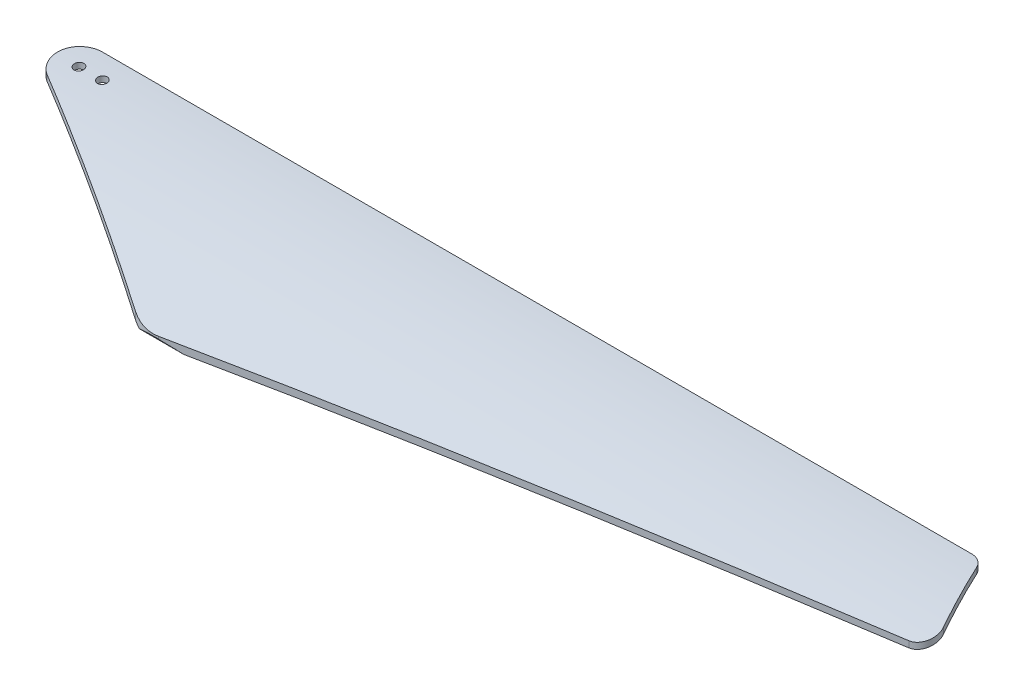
ISO-10303-21;
HEADER;
FILE_DESCRIPTION(('STEP AP214'),'2;1');
FILE_NAME('part.step','',(''),(''),'','','');
FILE_SCHEMA(('AUTOMOTIVE_DESIGN { 1 0 10303 214 1 1 1 1 }'));
ENDSEC;
DATA;
#1=APPLICATION_CONTEXT('core data for automotive mechanical design processes');
#2=APPLICATION_PROTOCOL_DEFINITION('international standard','automotive_design',2000,#1);
#3=PRODUCT_CONTEXT('',#1,'mechanical');
#4=PRODUCT('Part','Part','',(#3));
#5=PRODUCT_RELATED_PRODUCT_CATEGORY('part','',(#4));
#6=PRODUCT_DEFINITION_FORMATION('','',#4);
#7=PRODUCT_DEFINITION_CONTEXT('part definition',#1,'design');
#8=PRODUCT_DEFINITION('design','',#6,#7);
#9=PRODUCT_DEFINITION_SHAPE('','',#8);
#10=(LENGTH_UNIT() NAMED_UNIT(*) SI_UNIT(.MILLI.,.METRE.));
#11=(NAMED_UNIT(*) PLANE_ANGLE_UNIT() SI_UNIT($,.RADIAN.));
#12=(NAMED_UNIT(*) SI_UNIT($,.STERADIAN.) SOLID_ANGLE_UNIT());
#13=UNCERTAINTY_MEASURE_WITH_UNIT(LENGTH_MEASURE(1.E-05),#10,'distance_accuracy_value','');
#14=(GEOMETRIC_REPRESENTATION_CONTEXT(3) GLOBAL_UNCERTAINTY_ASSIGNED_CONTEXT((#13)) GLOBAL_UNIT_ASSIGNED_CONTEXT((#10,
#11,#12)) REPRESENTATION_CONTEXT('',''));
#15=CARTESIAN_POINT('',(0.,0.,0.));
#16=DIRECTION('',(0.,0.,1.));
#17=DIRECTION('',(1.,0.,0.));
#18=AXIS2_PLACEMENT_3D('',#15,#16,#17);
#19=CARTESIAN_POINT('',(480.,-135.663152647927,0.));
#20=DIRECTION('',(-1.,0.,0.));
#21=DIRECTION('',(0.,0.,1.));
#22=AXIS2_PLACEMENT_3D('',#19,#20,#21);
#23=CYLINDRICAL_SURFACE('',#22,132.663152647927);
#24=CARTESIAN_POINT('',(24.,-3.7948013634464,14.5000000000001));
#25=CARTESIAN_POINT('',(24.1398315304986,-3.79480046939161,14.4999936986));
#26=CARTESIAN_POINT('',(24.2797645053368,-3.79350525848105,14.4882277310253));
#27=CARTESIAN_POINT('',(24.5557635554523,-3.78837634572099,14.4414672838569));
#28=CARTESIAN_POINT('',(24.691824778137,-3.78453959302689,14.4064448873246));
#29=CARTESIAN_POINT('',(24.9560293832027,-3.77449650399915,14.3142093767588));
#30=CARTESIAN_POINT('',(25.0841776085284,-3.76829163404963,14.2570099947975));
#31=CARTESIAN_POINT('',(25.328998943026,-3.75377836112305,14.1220970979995));
#32=CARTESIAN_POINT('',(25.4456747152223,-3.74547044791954,14.0443883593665));
#33=CARTESIAN_POINT('',(25.6646773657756,-3.72706500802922,13.8704181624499));
#34=CARTESIAN_POINT('',(25.7669598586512,-3.71696215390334,13.7741013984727));
#35=CARTESIAN_POINT('',(25.9539275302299,-3.69538440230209,13.5658083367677));
#36=CARTESIAN_POINT('',(26.0386115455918,-3.68390941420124,13.4538310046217));
#37=CARTESIAN_POINT('',(26.1884535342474,-3.6599547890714,13.2167347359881));
#38=CARTESIAN_POINT('',(26.2535033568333,-3.64747005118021,13.0915479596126));
#39=CARTESIAN_POINT('',(26.3616537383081,-3.621996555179,12.8320749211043));
#40=CARTESIAN_POINT('',(26.4047538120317,-3.60900778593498,12.6977884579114));
#41=CARTESIAN_POINT('',(26.4679244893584,-3.5829085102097,12.4233745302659));
#42=CARTESIAN_POINT('',(26.487907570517,-3.56979772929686,12.2832269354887));
#43=CARTESIAN_POINT('',(26.5039767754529,-3.54390660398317,12.0015373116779));
#44=CARTESIAN_POINT('',(26.5000627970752,-3.53112626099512,11.8599952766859));
#45=CARTESIAN_POINT('',(26.4684175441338,-3.50624639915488,11.5794664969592));
#46=CARTESIAN_POINT('',(26.4406747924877,-3.4941472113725,11.4404810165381));
#47=CARTESIAN_POINT('',(26.3621108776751,-3.47093762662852,11.1691054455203));
#48=CARTESIAN_POINT('',(26.311289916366,-3.45982722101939,11.0367152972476));
#49=CARTESIAN_POINT('',(26.1881229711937,-3.438860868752,10.7826233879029));
#50=CARTESIAN_POINT('',(26.1158261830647,-3.42900212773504,10.6608980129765));
#51=CARTESIAN_POINT('',(25.9516922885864,-3.41069230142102,10.4313032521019));
#52=CARTESIAN_POINT('',(25.8598555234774,-3.40224119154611,10.323433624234));
#53=CARTESIAN_POINT('',(25.6595767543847,-3.38690284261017,10.1250038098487));
#54=CARTESIAN_POINT('',(25.5511910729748,-3.38001048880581,10.034387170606));
#55=CARTESIAN_POINT('',(25.3206636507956,-3.3678401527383,9.87263708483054));
#56=CARTESIAN_POINT('',(25.1985221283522,-3.36256214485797,9.80150332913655));
#57=CARTESIAN_POINT('',(24.9443325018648,-3.35368653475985,9.68095594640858));
#58=CARTESIAN_POINT('',(24.812314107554,-3.3500841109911,9.63148002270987));
#59=CARTESIAN_POINT('',(24.541814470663,-3.34456631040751,9.55537798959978));
#60=CARTESIAN_POINT('',(24.4033332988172,-3.34265091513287,9.52875163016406));
#61=CARTESIAN_POINT('',(24.1240991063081,-3.34052213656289,9.49914467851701));
#62=CARTESIAN_POINT('',(23.9833504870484,-3.34030577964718,9.49612277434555));
#63=CARTESIAN_POINT('',(23.7033446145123,-3.34156860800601,9.51370287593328));
#64=CARTESIAN_POINT('',(23.5640873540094,-3.3430477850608,9.53430476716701));
#65=CARTESIAN_POINT('',(23.2910817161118,-3.34769079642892,9.5985233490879));
#66=CARTESIAN_POINT('',(23.1573308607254,-3.35085386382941,9.64212956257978));
#67=CARTESIAN_POINT('',(22.8990591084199,-3.35883985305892,9.75109498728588));
#68=CARTESIAN_POINT('',(22.7745382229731,-3.36366277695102,9.81645422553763));
#69=CARTESIAN_POINT('',(22.5381425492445,-3.37492776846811,9.96711180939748));
#70=CARTESIAN_POINT('',(22.4262784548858,-3.38137119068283,10.0524268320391));
#71=CARTESIAN_POINT('',(22.2184640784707,-3.39579951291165,10.240519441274));
#72=CARTESIAN_POINT('',(22.1225139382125,-3.40378442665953,10.343297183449));
#73=CARTESIAN_POINT('',(21.9490252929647,-3.4211988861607,10.5636143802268));
#74=CARTESIAN_POINT('',(21.8715261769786,-3.43063145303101,10.6811846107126));
#75=CARTESIAN_POINT('',(21.737356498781,-3.4507640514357,10.9275628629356));
#76=CARTESIAN_POINT('',(21.6806862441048,-3.46146410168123,11.056371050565));
#77=CARTESIAN_POINT('',(21.5895898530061,-3.48394697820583,11.321990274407));
#78=CARTESIAN_POINT('',(21.5552337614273,-3.49573308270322,11.458825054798));
#79=CARTESIAN_POINT('',(21.5099813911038,-3.52007939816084,11.7362535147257));
#80=CARTESIAN_POINT('',(21.4990856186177,-3.53263962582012,11.8768472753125));
#81=CARTESIAN_POINT('',(21.5010377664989,-3.55823870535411,12.1582815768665));
#82=CARTESIAN_POINT('',(21.5139619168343,-3.57127896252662,12.2991214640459));
#83=CARTESIAN_POINT('',(21.5633267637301,-3.59741041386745,12.576614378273));
#84=CARTESIAN_POINT('',(21.599767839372,-3.61050160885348,12.7132673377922));
#85=CARTESIAN_POINT('',(21.6952248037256,-3.63632931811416,12.9787450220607));
#86=CARTESIAN_POINT('',(21.7542782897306,-3.64906520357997,13.1075562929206));
#87=CARTESIAN_POINT('',(21.8933033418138,-3.67370890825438,13.3534301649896));
#88=CARTESIAN_POINT('',(21.9732740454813,-3.68561676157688,13.4704932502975));
#89=CARTESIAN_POINT('',(22.1517564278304,-3.70813809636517,13.6893502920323));
#90=CARTESIAN_POINT('',(22.2502392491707,-3.71875355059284,13.7911675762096));
#91=CARTESIAN_POINT('',(22.4630908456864,-3.73829126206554,13.9768293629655));
#92=CARTESIAN_POINT('',(22.5774632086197,-3.7472131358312,14.0606697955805));
#93=CARTESIAN_POINT('',(22.8183208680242,-3.76295609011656,14.2075921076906));
#94=CARTESIAN_POINT('',(22.944755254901,-3.76978552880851,14.2707566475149));
#95=CARTESIAN_POINT('',(23.2064361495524,-3.78109258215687,14.3748764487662));
#96=CARTESIAN_POINT('',(23.3416714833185,-3.78557311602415,14.4158592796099));
#97=CARTESIAN_POINT('',(23.5648284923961,-3.79077976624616,14.4633900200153));
#98=CARTESIAN_POINT('',(23.6512719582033,-3.79228511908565,14.4771010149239));
#99=CARTESIAN_POINT('',(23.8251303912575,-3.79429619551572,14.4954079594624));
#100=CARTESIAN_POINT('',(23.9125453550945,-3.79480192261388,14.5000039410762));
#101=CARTESIAN_POINT('',(24.,-3.7948013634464,14.5000000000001));
#102=B_SPLINE_CURVE_WITH_KNOTS('',3,(#24,#25,#26,#27,#28,#29,#30,#31,#32,#33,#34,#35,#36,#37,
#38,#39,#40,#41,#42,#43,#44,#45,#46,#47,#48,#49,#50,#51,#52,#53,#54,#55,#56,#57,#58,#59,#60,#61,
#62,#63,#64,#65,#66,#67,#68,#69,#70,#71,#72,#73,#74,#75,#76,#77,#78,#79,#80,#81,#82,#83,#84,#85,
#86,#87,#88,#89,#90,#91,#92,#93,#94,#95,#96,#97,#98,#99,#100,#101),.UNSPECIFIED.,.T.,.F.,(4,2,2,
2,2,2,2,2,2,2,2,2,2,2,2,2,2,2,2,2,2,2,2,2,2,2,2,2,2,2,2,2,2,2,2,2,2,2,4),(0.,0.41917431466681,
0.838852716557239,1.25827166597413,1.67759302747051,2.09818039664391,2.5187955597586,
2.94168699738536,3.36458778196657,3.78908450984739,4.2135830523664,4.63828616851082,
5.06298556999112,5.48671949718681,5.91044602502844,6.33276132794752,6.75506992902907,
7.17615568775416,7.59723683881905,8.01758085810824,8.43792283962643,8.85807354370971,
9.27822477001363,9.69872837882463,10.1192357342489,10.5406328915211,10.9620362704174,
11.3847561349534,11.8074851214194,12.2315693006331,12.6556603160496,13.080459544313,
13.5052412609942,13.9293662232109,14.3535871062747,14.7760906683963,15.1980678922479,
15.460232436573,15.7223960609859),.UNSPECIFIED.);
#103=CARTESIAN_POINT('',(24.,-3.7948013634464,14.5000000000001));
#104=VERTEX_POINT('',#103);
#105=EDGE_CURVE('E142',#104,#104,#102,.T.);
#106=ORIENTED_EDGE('',*,*,#105,.T.);
#107=EDGE_LOOP('',(#106));
#108=FACE_BOUND('',#107,.T.);
#109=CARTESIAN_POINT('',(12.,-3.7948013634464,14.5000000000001));
#110=CARTESIAN_POINT('',(12.1398315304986,-3.79480046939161,14.4999936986));
#111=CARTESIAN_POINT('',(12.2797645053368,-3.79350525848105,14.4882277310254));
#112=CARTESIAN_POINT('',(12.5557635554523,-3.78837634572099,14.4414672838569));
#113=CARTESIAN_POINT('',(12.691824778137,-3.78453959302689,14.4064448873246));
#114=CARTESIAN_POINT('',(12.9560293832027,-3.77449650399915,14.3142093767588));
#115=CARTESIAN_POINT('',(13.0841776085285,-3.76829163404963,14.2570099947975));
#116=CARTESIAN_POINT('',(13.328998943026,-3.75377836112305,14.1220970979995));
#117=CARTESIAN_POINT('',(13.4456747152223,-3.74547044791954,14.0443883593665));
#118=CARTESIAN_POINT('',(13.6646773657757,-3.72706500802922,13.8704181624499));
#119=CARTESIAN_POINT('',(13.7669598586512,-3.71696215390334,13.7741013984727));
#120=CARTESIAN_POINT('',(13.9539275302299,-3.69538440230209,13.5658083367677));
#121=CARTESIAN_POINT('',(14.0386115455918,-3.68390941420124,13.4538310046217));
#122=CARTESIAN_POINT('',(14.1884535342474,-3.6599547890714,13.2167347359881));
#123=CARTESIAN_POINT('',(14.2535033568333,-3.64747005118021,13.0915479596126));
#124=CARTESIAN_POINT('',(14.3616537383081,-3.621996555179,12.8320749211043));
#125=CARTESIAN_POINT('',(14.4047538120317,-3.60900778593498,12.6977884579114));
#126=CARTESIAN_POINT('',(14.4679244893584,-3.5829085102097,12.4233745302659));
#127=CARTESIAN_POINT('',(14.487907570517,-3.56979772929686,12.2832269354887));
#128=CARTESIAN_POINT('',(14.5039767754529,-3.54390660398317,12.0015373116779));
#129=CARTESIAN_POINT('',(14.5000627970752,-3.53112626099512,11.8599952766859));
#130=CARTESIAN_POINT('',(14.4684175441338,-3.50624639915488,11.5794664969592));
#131=CARTESIAN_POINT('',(14.4406747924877,-3.4941472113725,11.4404810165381));
#132=CARTESIAN_POINT('',(14.3621108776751,-3.47093762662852,11.1691054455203));
#133=CARTESIAN_POINT('',(14.311289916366,-3.45982722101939,11.0367152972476));
#134=CARTESIAN_POINT('',(14.1881229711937,-3.438860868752,10.7826233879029));
#135=CARTESIAN_POINT('',(14.1158261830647,-3.42900212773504,10.6608980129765));
#136=CARTESIAN_POINT('',(13.9516922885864,-3.41069230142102,10.4313032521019));
#137=CARTESIAN_POINT('',(13.8598555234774,-3.40224119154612,10.323433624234));
#138=CARTESIAN_POINT('',(13.6595767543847,-3.38690284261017,10.1250038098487));
#139=CARTESIAN_POINT('',(13.5511910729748,-3.38001048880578,10.034387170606));
#140=CARTESIAN_POINT('',(13.3206636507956,-3.36784015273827,9.87263708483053));
#141=CARTESIAN_POINT('',(13.1985221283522,-3.36256214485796,9.80150332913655));
#142=CARTESIAN_POINT('',(12.9443325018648,-3.35368653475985,9.68095594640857));
#143=CARTESIAN_POINT('',(12.812314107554,-3.3500841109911,9.63148002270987));
#144=CARTESIAN_POINT('',(12.541814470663,-3.34456631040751,9.55537798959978));
#145=CARTESIAN_POINT('',(12.4033332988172,-3.34265091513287,9.52875163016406));
#146=CARTESIAN_POINT('',(12.1240991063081,-3.34052213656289,9.499144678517));
#147=CARTESIAN_POINT('',(11.9833504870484,-3.34030577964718,9.49612277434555));
#148=CARTESIAN_POINT('',(11.7033446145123,-3.34156860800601,9.51370287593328));
#149=CARTESIAN_POINT('',(11.5640873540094,-3.3430477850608,9.53430476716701));
#150=CARTESIAN_POINT('',(11.2910817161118,-3.34769079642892,9.5985233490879));
#151=CARTESIAN_POINT('',(11.1573308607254,-3.35085386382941,9.64212956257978));
#152=CARTESIAN_POINT('',(10.8990591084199,-3.35883985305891,9.75109498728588));
#153=CARTESIAN_POINT('',(10.7745382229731,-3.36366277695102,9.81645422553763));
#154=CARTESIAN_POINT('',(10.5381425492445,-3.37492776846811,9.96711180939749));
#155=CARTESIAN_POINT('',(10.4262784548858,-3.38137119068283,10.0524268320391));
#156=CARTESIAN_POINT('',(10.2184640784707,-3.39579951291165,10.240519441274));
#157=CARTESIAN_POINT('',(10.1225139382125,-3.40378442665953,10.343297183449));
#158=CARTESIAN_POINT('',(9.94902529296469,-3.4211988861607,10.5636143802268));
#159=CARTESIAN_POINT('',(9.87152617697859,-3.43063145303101,10.6811846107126));
#160=CARTESIAN_POINT('',(9.73735649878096,-3.4507640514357,10.9275628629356));
#161=CARTESIAN_POINT('',(9.68068624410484,-3.46146410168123,11.056371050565));
#162=CARTESIAN_POINT('',(9.58958985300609,-3.48394697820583,11.321990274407));
#163=CARTESIAN_POINT('',(9.55523376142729,-3.49573308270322,11.458825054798));
#164=CARTESIAN_POINT('',(9.50998139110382,-3.52007939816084,11.7362535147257));
#165=CARTESIAN_POINT('',(9.49908561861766,-3.53263962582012,11.8768472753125));
#166=CARTESIAN_POINT('',(9.50103776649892,-3.55823870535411,12.1582815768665));
#167=CARTESIAN_POINT('',(9.51396191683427,-3.57127896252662,12.2991214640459));
#168=CARTESIAN_POINT('',(9.5633267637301,-3.59741041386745,12.576614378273));
#169=CARTESIAN_POINT('',(9.59976783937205,-3.61050160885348,12.7132673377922));
#170=CARTESIAN_POINT('',(9.69522480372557,-3.63632931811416,12.9787450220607));
#171=CARTESIAN_POINT('',(9.75427828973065,-3.64906520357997,13.1075562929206));
#172=CARTESIAN_POINT('',(9.89330334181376,-3.67370890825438,13.3534301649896));
#173=CARTESIAN_POINT('',(9.97327404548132,-3.68561676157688,13.4704932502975));
#174=CARTESIAN_POINT('',(10.1517564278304,-3.70813809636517,13.6893502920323));
#175=CARTESIAN_POINT('',(10.2502392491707,-3.71875355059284,13.7911675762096));
#176=CARTESIAN_POINT('',(10.4630908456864,-3.73829126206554,13.9768293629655));
#177=CARTESIAN_POINT('',(10.5774632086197,-3.7472131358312,14.0606697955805));
#178=CARTESIAN_POINT('',(10.8183208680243,-3.76295609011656,14.2075921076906));
#179=CARTESIAN_POINT('',(10.944755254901,-3.76978552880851,14.2707566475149));
#180=CARTESIAN_POINT('',(11.2064361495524,-3.78109258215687,14.3748764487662));
#181=CARTESIAN_POINT('',(11.3416714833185,-3.78557311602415,14.4158592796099));
#182=CARTESIAN_POINT('',(11.5648284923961,-3.79077976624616,14.4633900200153));
#183=CARTESIAN_POINT('',(11.6512719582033,-3.79228511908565,14.4771010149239));
#184=CARTESIAN_POINT('',(11.8251303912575,-3.79429619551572,14.4954079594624));
#185=CARTESIAN_POINT('',(11.9125453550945,-3.79480192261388,14.5000039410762));
#186=CARTESIAN_POINT('',(12.,-3.7948013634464,14.5000000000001));
#187=B_SPLINE_CURVE_WITH_KNOTS('',3,(#109,#110,#111,#112,#113,#114,#115,#116,#117,#118,#119,
#120,#121,#122,#123,#124,#125,#126,#127,#128,#129,#130,#131,#132,#133,#134,#135,#136,#137,#138,
#139,#140,#141,#142,#143,#144,#145,#146,#147,#148,#149,#150,#151,#152,#153,#154,#155,#156,#157,
#158,#159,#160,#161,#162,#163,#164,#165,#166,#167,#168,#169,#170,#171,#172,#173,#174,#175,#176,
#177,#178,#179,#180,#181,#182,#183,#184,#185,#186),.UNSPECIFIED.,.T.,.F.,(4,2,2,2,2,2,2,2,2,2,2,
2,2,2,2,2,2,2,2,2,2,2,2,2,2,2,2,2,2,2,2,2,2,2,2,2,2,2,4),(0.,0.419174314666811,
0.838852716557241,1.25827166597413,1.67759302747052,2.09818039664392,2.5187955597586,
2.94168699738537,3.36458778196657,3.78908450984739,4.21358305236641,4.63828616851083,
5.06298556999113,5.48671949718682,5.91044602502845,6.33276132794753,6.75506992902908,
7.17615568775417,7.59723683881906,8.01758085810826,8.43792283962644,8.85807354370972,
9.27822477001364,9.69872837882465,10.1192357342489,10.5406328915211,10.9620362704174,
11.3847561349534,11.8074851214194,12.2315693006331,12.6556603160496,13.080459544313,
13.5052412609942,13.9293662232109,14.3535871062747,14.7760906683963,15.1980678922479,
15.460232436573,15.7223960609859),.UNSPECIFIED.);
#188=CARTESIAN_POINT('',(12.,-3.7948013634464,14.5000000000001));
#189=VERTEX_POINT('',#188);
#190=EDGE_CURVE('E132',#189,#189,#187,.T.);
#191=ORIENTED_EDGE('',*,*,#190,.T.);
#192=EDGE_LOOP('',(#191));
#193=FACE_BOUND('',#192,.T.);
#194=CARTESIAN_POINT('',(465.784853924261,-3.085501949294,4.76220597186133));
#195=CARTESIAN_POINT('',(465.693930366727,-3.0781170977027,4.55671145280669));
#196=CARTESIAN_POINT('',(465.59429813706,-3.07135529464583,4.35505273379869));
#197=CARTESIAN_POINT('',(465.378419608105,-3.05899464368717,3.96080825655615));
#198=CARTESIAN_POINT('',(465.262174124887,-3.05339573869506,3.7682220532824));
#199=CARTESIAN_POINT('',(465.013970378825,-3.04328139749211,3.3936651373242));
#200=CARTESIAN_POINT('',(464.882025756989,-3.03876503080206,3.21168541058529));
#201=CARTESIAN_POINT('',(464.603287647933,-3.03070342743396,2.85945886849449));
#202=CARTESIAN_POINT('',(464.456494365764,-3.02715817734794,2.68921189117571));
#203=CARTESIAN_POINT('',(464.149038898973,-3.02092039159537,2.36160057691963));
#204=CARTESIAN_POINT('',(463.988371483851,-3.01822817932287,2.20424114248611));
#205=CARTESIAN_POINT('',(463.654353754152,-3.01357289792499,1.90359446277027));
#206=CARTESIAN_POINT('',(463.481003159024,-3.01160984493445,1.76030752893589));
#207=CARTESIAN_POINT('',(463.122837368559,-3.00828491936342,1.48881740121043));
#208=CARTESIAN_POINT('',(462.938021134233,-3.00692310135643,1.36061557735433));
#209=CARTESIAN_POINT('',(462.558256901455,-3.00467527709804,1.12022607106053));
#210=CARTESIAN_POINT('',(462.36330920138,-3.00378925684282,1.00803791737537));
#211=CARTESIAN_POINT('',(461.96448323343,-3.0023737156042,0.800375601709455));
#212=CARTESIAN_POINT('',(461.760597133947,-3.00184451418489,0.704916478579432));
#213=CARTESIAN_POINT('',(461.345511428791,-3.00103641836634,0.531516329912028));
#214=CARTESIAN_POINT('',(461.134311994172,-3.00075751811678,0.453574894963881));
#215=CARTESIAN_POINT('',(460.706273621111,-3.00035802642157,0.315817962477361));
#216=CARTESIAN_POINT('',(460.489439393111,-3.00023730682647,0.255987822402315));
#217=CARTESIAN_POINT('',(460.051584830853,-3.00008070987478,0.154811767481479));
#218=CARTESIAN_POINT('',(459.830566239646,-3.00004479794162,0.1134583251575));
#219=CARTESIAN_POINT('',(459.419506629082,-3.00000823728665,0.0543386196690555));
#220=CARTESIAN_POINT('',(459.22983810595,-3.00000307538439,0.0339502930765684));
#221=CARTESIAN_POINT('',(458.849897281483,-3.00000004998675,0.00678877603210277));
#222=CARTESIAN_POINT('',(458.659626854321,-3.00000217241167,-1.06398423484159E-05));
#223=CARTESIAN_POINT('',(458.469343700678,-3.,0.));
#224=B_SPLINE_CURVE_WITH_KNOTS('',3,(#194,#195,#196,#197,#198,#199,#200,#201,#202,#203,#204,
#205,#206,#207,#208,#209,#210,#211,#212,#213,#214,#215,#216,#217,#218,#219,#220,#221,#222,#223),
.UNSPECIFIED.,.F.,.F.,(4,2,2,2,2,2,2,2,2,2,2,2,2,2,4),(0.,0.674291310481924,1.3485495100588,
2.02222606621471,2.69589332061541,3.36981566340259,4.04375291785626,4.71775133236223,
5.39172990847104,6.06631129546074,6.7408769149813,7.41489569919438,8.08863963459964,
8.66044773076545,9.23115121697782),.UNSPECIFIED.);
#225=CARTESIAN_POINT('',(465.784853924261,-3.08550194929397,4.76220597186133));
#226=VERTEX_POINT('',#225);
#227=CARTESIAN_POINT('',(458.469343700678,-3.,0.));
#228=VERTEX_POINT('',#227);
#229=EDGE_CURVE('E61',#226,#228,#224,.T.);
#230=ORIENTED_EDGE('',*,*,#229,.F.);
#231=CARTESIAN_POINT('',(463.677134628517,-135.663152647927,0.));
#232=DIRECTION('',(0.914438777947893,0.,-0.404724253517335));
#233=DIRECTION('',(-0.404724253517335,0.,-0.914438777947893));
#234=AXIS2_PLACEMENT_3D('',#231,#232,#233);
#235=ELLIPSE('',#234,145.07603553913,132.663152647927);
#236=CARTESIAN_POINT('',(479.315510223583,-7.79191413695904,35.3335312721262));
#237=VERTEX_POINT('',#236);
#238=EDGE_CURVE('E171',#237,#226,#235,.F.);
#239=ORIENTED_EDGE('',*,*,#238,.F.);
#240=CARTESIAN_POINT('',(472.841319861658,-11.4264683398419,46.5269636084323));
#241=CARTESIAN_POINT('',(473.058022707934,-11.417901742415,46.5040780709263));
#242=CARTESIAN_POINT('',(473.273635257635,-11.4060018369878,46.4722943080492));
#243=CARTESIAN_POINT('',(473.701068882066,-11.3757741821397,46.3913974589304));
#244=CARTESIAN_POINT('',(473.912890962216,-11.3574481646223,46.3422890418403));
#245=CARTESIAN_POINT('',(474.330659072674,-11.3146628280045,46.2273600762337));
#246=CARTESIAN_POINT('',(474.536620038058,-11.29022101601,46.1615872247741));
#247=CARTESIAN_POINT('',(474.941873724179,-11.2355049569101,46.013897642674));
#248=CARTESIAN_POINT('',(475.141166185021,-11.2052304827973,45.9319802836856));
#249=CARTESIAN_POINT('',(475.531594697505,-11.1392586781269,45.7528249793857));
#250=CARTESIAN_POINT('',(475.722737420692,-11.10356589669,45.6555998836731));
#251=CARTESIAN_POINT('',(476.095920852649,-11.0271529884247,45.4465844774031));
#252=CARTESIAN_POINT('',(476.277958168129,-10.9864310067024,45.3347887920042));
#253=CARTESIAN_POINT('',(476.631796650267,-10.9004281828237,45.0975671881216));
#254=CARTESIAN_POINT('',(476.803597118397,-10.8551470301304,44.9721403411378));
#255=CARTESIAN_POINT('',(477.136058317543,-10.7604931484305,44.7085822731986));
#256=CARTESIAN_POINT('',(477.296714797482,-10.7111188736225,44.5704462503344));
#257=CARTESIAN_POINT('',(477.611579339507,-10.6069326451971,44.2772962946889));
#258=CARTESIAN_POINT('',(477.765343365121,-10.5519885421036,44.1218523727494));
#259=CARTESIAN_POINT('',(478.059159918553,-10.4387853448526,43.7995329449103));
#260=CARTESIAN_POINT('',(478.199207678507,-10.3805251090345,43.6326534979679));
#261=CARTESIAN_POINT('',(478.464823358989,-10.2612515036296,43.2886635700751));
#262=CARTESIAN_POINT('',(478.590390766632,-10.2002380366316,43.1115527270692));
#263=CARTESIAN_POINT('',(478.826421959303,-10.0759952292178,42.74827266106));
#264=CARTESIAN_POINT('',(478.936885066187,-10.0127657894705,42.5621030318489));
#265=CARTESIAN_POINT('',(479.148000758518,-9.88097088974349,42.1710773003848));
#266=CARTESIAN_POINT('',(479.247739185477,-9.81230638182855,41.9657604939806));
#267=CARTESIAN_POINT('',(479.429165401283,-9.67370473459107,41.5477983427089));
#268=CARTESIAN_POINT('',(479.510858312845,-9.60376796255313,41.3351550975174));
#269=CARTESIAN_POINT('',(479.655817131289,-9.4631303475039,40.9037643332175));
#270=CARTESIAN_POINT('',(479.719071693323,-9.39242906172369,40.6850131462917));
#271=CARTESIAN_POINT('',(479.826688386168,-9.25087922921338,40.24304939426));
#272=CARTESIAN_POINT('',(479.871057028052,-9.18003074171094,40.019838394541));
#273=CARTESIAN_POINT('',(479.94177612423,-9.03636723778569,39.5629685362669));
#274=CARTESIAN_POINT('',(479.967488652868,-8.9635638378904,39.3292069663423));
#275=CARTESIAN_POINT('',(479.998238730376,-8.8189067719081,38.8601284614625));
#276=CARTESIAN_POINT('',(480.0032835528,-8.7470527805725,38.6248121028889));
#277=CARTESIAN_POINT('',(479.992586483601,-8.60482006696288,38.1543253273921));
#278=CARTESIAN_POINT('',(479.976855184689,-8.53444061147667,37.9191548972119));
#279=CARTESIAN_POINT('',(479.924623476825,-8.39563720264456,37.4506515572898));
#280=CARTESIAN_POINT('',(479.888129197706,-8.32721267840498,37.2173181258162));
#281=CARTESIAN_POINT('',(479.784078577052,-8.17785199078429,36.7028171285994));
#282=CARTESIAN_POINT('',(479.711438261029,-8.09749466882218,36.4224806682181));
#283=CARTESIAN_POINT('',(479.579800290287,-7.98028794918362,36.0085927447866));
#284=CARTESIAN_POINT('',(479.532166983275,-7.94178991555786,35.8717908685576));
#285=CARTESIAN_POINT('',(479.429424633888,-7.86595998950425,35.600694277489));
#286=CARTESIAN_POINT('',(479.374315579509,-7.82862809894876,35.4663995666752));
#287=CARTESIAN_POINT('',(479.315510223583,-7.79191413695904,35.3335312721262));
#288=B_SPLINE_CURVE_WITH_KNOTS('',3,(#240,#241,#242,#243,#244,#245,#246,#247,#248,#249,#250,
#251,#252,#253,#254,#255,#256,#257,#258,#259,#260,#261,#262,#263,#264,#265,#266,#267,#268,#269,
#270,#271,#272,#273,#274,#275,#276,#277,#278,#279,#280,#281,#282,#283,#284,#285,#286,#287),
.UNSPECIFIED.,.F.,.F.,(4,2,2,2,2,2,2,2,2,2,2,2,2,2,2,2,2,2,2,2,2,2,2,4),(0.,0.653994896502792,
1.30781366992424,1.95978181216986,2.61177533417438,3.26322445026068,3.91491455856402,
4.56664908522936,5.21863087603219,5.89421704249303,6.57003721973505,7.24588132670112,
7.92175576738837,8.63603620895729,9.35011362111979,10.0646294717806,10.7788987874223,
11.5165686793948,12.2539789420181,12.9910133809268,13.7278303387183,14.6275665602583,
15.0770444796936,15.5265231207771),.UNSPECIFIED.);
#289=CARTESIAN_POINT('',(472.841319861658,-11.4264683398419,46.5269636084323));
#290=VERTEX_POINT('',#289);
#291=EDGE_CURVE('E199',#290,#237,#288,.T.);
#292=ORIENTED_EDGE('',*,*,#291,.F.);
#293=CARTESIAN_POINT('',(912.806796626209,-135.663152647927,0.));
#294=DIRECTION('',(0.105164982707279,0.,0.994454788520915));
#295=DIRECTION('',(-0.994454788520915,0.,0.105164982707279));
#296=AXIS2_PLACEMENT_3D('',#293,#294,#295);
#297=ELLIPSE('',#296,1261.47648421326,132.663152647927);
#298=CARTESIAN_POINT('',(136.056222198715,-31.4896019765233,82.1424580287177));
#299=VERTEX_POINT('',#298);
#300=EDGE_CURVE('E259',#299,#290,#297,.F.);
#301=ORIENTED_EDGE('',*,*,#300,.F.);
#302=DIRECTION('',(-1.,0.,0.));
#303=VECTOR('',#302,1.);
#304=CARTESIAN_POINT('',(480.,-31.4896019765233,82.1424580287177));
#305=LINE('',#304,#303);
#306=CARTESIAN_POINT('',(113.256065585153,-31.4896019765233,82.1424580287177));
#307=VERTEX_POINT('',#306);
#308=EDGE_CURVE('E127',#299,#307,#305,.T.);
#309=ORIENTED_EDGE('',*,*,#308,.T.);
#310=CARTESIAN_POINT('',(109.269133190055,-30.0962437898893,80.3438847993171));
#311=CARTESIAN_POINT('',(109.582603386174,-30.2301239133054,80.5197958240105));
#312=CARTESIAN_POINT('',(109.901164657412,-30.3601019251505,80.6896656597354));
#313=CARTESIAN_POINT('',(110.547273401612,-30.6111879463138,81.0162889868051));
#314=CARTESIAN_POINT('',(110.874797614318,-30.7323163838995,81.1730728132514));
#315=CARTESIAN_POINT('',(111.539149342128,-30.965288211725,81.4733416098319));
#316=CARTESIAN_POINT('',(111.87597721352,-31.0771312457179,81.616826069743));
#317=CARTESIAN_POINT('',(112.559177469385,-31.2910133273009,81.8901626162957));
#318=CARTESIAN_POINT('',(112.905570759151,-31.3930282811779,82.0199812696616));
#319=CARTESIAN_POINT('',(113.256065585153,-31.4896019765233,82.1424580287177));
#320=B_SPLINE_CURVE_WITH_KNOTS('',3,(#310,#311,#312,#313,#314,#315,#316,#317,#318,#319),
.UNSPECIFIED.,.F.,.F.,(4,2,2,2,4),(0.,1.15067385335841,2.29860158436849,3.44657333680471,
4.59729133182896),.UNSPECIFIED.);
#321=CARTESIAN_POINT('',(109.269133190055,-30.0962437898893,80.3438847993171));
#322=VERTEX_POINT('',#321);
#323=EDGE_CURVE('E53',#322,#307,#320,.T.);
#324=ORIENTED_EDGE('',*,*,#323,.F.);
#325=CARTESIAN_POINT('',(-33.9054036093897,-135.663152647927,0.));
#326=DIRECTION('',(-0.489373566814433,0.,0.872074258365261));
#327=DIRECTION('',(-0.872074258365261,0.,-0.489373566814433));
#328=AXIS2_PLACEMENT_3D('',#325,#326,#327);
#329=ELLIPSE('',#328,271.08769587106,132.663152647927);
#330=CARTESIAN_POINT('',(6.1275171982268,-4.91591275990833,22.4648911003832));
#331=VERTEX_POINT('',#330);
#332=EDGE_CURVE('E254',#331,#322,#329,.F.);
#333=ORIENTED_EDGE('',*,*,#332,.F.);
#334=CARTESIAN_POINT('',(12.,-3.,0.));
#335=CARTESIAN_POINT('',(11.6625245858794,-3.00000969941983,-3.62749158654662E-05));
#336=CARTESIAN_POINT('',(11.3250543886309,-3.00000030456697,0.0142346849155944));
#337=CARTESIAN_POINT('',(10.6525278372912,-3.00001342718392,0.0711290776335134));
#338=CARTESIAN_POINT('',(10.3174713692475,-3.00003594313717,0.113751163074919));
#339=CARTESIAN_POINT('',(9.6523702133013,-3.00018292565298,0.227047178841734));
#340=CARTESIAN_POINT('',(9.32232226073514,-3.0003073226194,0.29770194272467));
#341=CARTESIAN_POINT('',(8.66935190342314,-3.00079336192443,0.466549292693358));
#342=CARTESIAN_POINT('',(8.34642941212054,-3.00115500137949,0.56474154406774));
#343=CARTESIAN_POINT('',(7.7098484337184,-3.00229355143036,0.788022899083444));
#344=CARTESIAN_POINT('',(7.39619443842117,-3.00307066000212,0.91312480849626));
#345=CARTESIAN_POINT('',(6.78054257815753,-3.0052592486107,1.18930673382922));
#346=CARTESIAN_POINT('',(6.47854470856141,-3.00667072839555,1.34038673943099));
#347=CARTESIAN_POINT('',(5.88841313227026,-3.01037841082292,1.6674163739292));
#348=CARTESIAN_POINT('',(5.60027667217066,-3.01267443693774,1.84336103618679));
#349=CARTESIAN_POINT('',(5.03985588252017,-3.01842468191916,2.21888728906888));
#350=CARTESIAN_POINT('',(4.76757147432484,-3.02187889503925,2.41846876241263));
#351=CARTESIAN_POINT('',(4.24087855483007,-3.03023022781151,2.83977493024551));
#352=CARTESIAN_POINT('',(3.98646424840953,-3.03512687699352,3.06149238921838));
#353=CARTESIAN_POINT('',(3.49722521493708,-3.04665104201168,3.52553870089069));
#354=CARTESIAN_POINT('',(3.2624005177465,-3.05327856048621,3.7678675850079));
#355=CARTESIAN_POINT('',(2.81398057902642,-3.06854353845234,4.27143426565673));
#356=CARTESIAN_POINT('',(2.60038838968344,-3.07718128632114,4.53267477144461));
#357=CARTESIAN_POINT('',(2.19599065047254,-3.09672342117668,5.07215444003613));
#358=CARTESIAN_POINT('',(2.00518506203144,-3.10762780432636,5.35039357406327));
#359=CARTESIAN_POINT('',(1.64797362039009,-3.13191075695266,5.92144675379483));
#360=CARTESIAN_POINT('',(1.48153248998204,-3.14528568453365,6.21423888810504));
#361=CARTESIAN_POINT('',(1.17388590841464,-3.17470260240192,6.81266509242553));
#362=CARTESIAN_POINT('',(1.03268042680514,-3.190744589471,7.11829914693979));
#363=CARTESIAN_POINT('',(0.77649631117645,-3.22562541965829,7.74018221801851));
#364=CARTESIAN_POINT('',(0.661515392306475,-3.24446401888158,8.0564303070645));
#365=CARTESIAN_POINT('',(0.458548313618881,-3.28501158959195,8.69729374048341));
#366=CARTESIAN_POINT('',(0.370562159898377,-3.30672056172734,9.02190908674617));
#367=CARTESIAN_POINT('',(0.22218271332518,-3.35301147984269,9.67710917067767));
#368=CARTESIAN_POINT('',(0.161783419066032,-3.37759279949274,10.0076925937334));
#369=CARTESIAN_POINT('',(0.0689265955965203,-3.42957094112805,10.6725403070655));
#370=CARTESIAN_POINT('',(0.0364690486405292,-3.45696776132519,11.0068045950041));
#371=CARTESIAN_POINT('',(-0.000332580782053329,-3.51444660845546,11.6766679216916));
#372=CARTESIAN_POINT('',(-0.00467483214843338,-3.54452881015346,12.0122670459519));
#373=CARTESIAN_POINT('',(0.0147308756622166,-3.60717370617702,12.6824191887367));
#374=CARTESIAN_POINT('',(0.0384789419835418,-3.63973640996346,13.0169722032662));
#375=CARTESIAN_POINT('',(0.114018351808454,-3.70722715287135,13.6842529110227));
#376=CARTESIAN_POINT('',(0.165940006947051,-3.74216551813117,14.0169648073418));
#377=CARTESIAN_POINT('',(0.297494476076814,-3.81392849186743,14.6766567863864));
#378=CARTESIAN_POINT('',(0.377127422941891,-3.85075310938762,15.0036368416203));
#379=CARTESIAN_POINT('',(0.563507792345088,-3.92588565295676,15.649610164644));
#380=CARTESIAN_POINT('',(0.670255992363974,-3.96419362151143,15.9686032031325));
#381=CARTESIAN_POINT('',(0.910092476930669,-4.04183319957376,16.5963968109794));
#382=CARTESIAN_POINT('',(1.04318066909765,-4.08116480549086,16.9051974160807));
#383=CARTESIAN_POINT('',(1.33595490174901,-4.16067119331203,17.5129707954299));
#384=CARTESIAN_POINT('',(1.49584963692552,-4.20085024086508,17.8118424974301));
#385=CARTESIAN_POINT('',(1.84034052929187,-4.28117994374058,18.3949983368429));
#386=CARTESIAN_POINT('',(2.02493667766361,-4.32133059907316,18.6792824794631));
#387=CARTESIAN_POINT('',(2.41751230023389,-4.40101097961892,19.2312242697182));
#388=CARTESIAN_POINT('',(2.62548736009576,-4.44054082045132,19.4988850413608));
#389=CARTESIAN_POINT('',(3.06340881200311,-4.51838277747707,20.0157363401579));
#390=CARTESIAN_POINT('',(3.29335207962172,-4.55669506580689,20.2649294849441));
#391=CARTESIAN_POINT('',(3.72595661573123,-4.6240723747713,20.6956314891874));
#392=CARTESIAN_POINT('',(3.92498013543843,-4.65346404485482,20.8807603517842));
#393=CARTESIAN_POINT('',(4.33523281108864,-4.71076591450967,21.2371618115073));
#394=CARTESIAN_POINT('',(4.54646009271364,-4.73867634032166,21.4084365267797));
#395=CARTESIAN_POINT('',(4.98006629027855,-4.79269901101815,21.7362379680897));
#396=CARTESIAN_POINT('',(5.20243799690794,-4.81881239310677,21.8927740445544));
#397=CARTESIAN_POINT('',(5.65749863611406,-4.86898008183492,22.1905208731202));
#398=CARTESIAN_POINT('',(5.89018957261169,-4.89303398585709,22.3317286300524));
#399=CARTESIAN_POINT('',(6.1275171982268,-4.91591275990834,22.4648911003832));
#400=B_SPLINE_CURVE_WITH_KNOTS('',3,(#334,#335,#336,#337,#338,#339,#340,#341,#342,#343,#344,
#345,#346,#347,#348,#349,#350,#351,#352,#353,#354,#355,#356,#357,#358,#359,#360,#361,#362,#363,
#364,#365,#366,#367,#368,#369,#370,#371,#372,#373,#374,#375,#376,#377,#378,#379,#380,#381,#382,
#383,#384,#385,#386,#387,#388,#389,#390,#391,#392,#393,#394,#395,#396,#397,#398,#399),
.UNSPECIFIED.,.F.,.F.,(4,2,2,2,2,2,2,2,2,2,2,2,2,2,2,2,2,2,2,2,2,2,2,2,2,2,2,2,2,2,2,2,4),(0.,
1.01211727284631,2.02418644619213,3.03556483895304,4.04693093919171,5.05877939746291,
6.07062745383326,7.08227368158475,8.09391488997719,9.10522650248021,10.1165396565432,
11.1279979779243,12.1394545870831,13.1494319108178,14.159408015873,15.1692960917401,
16.1791843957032,17.1888528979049,18.198520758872,19.2082543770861,20.217991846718,
21.2324399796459,22.2468929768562,23.2613750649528,24.2758535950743,25.2986317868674,
26.3214096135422,27.343994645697,28.3664344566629,29.186032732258,30.0055054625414,
30.8244547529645,31.6435637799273),.UNSPECIFIED.);
#401=CARTESIAN_POINT('',(12.,-3.,0.));
#402=VERTEX_POINT('',#401);
#403=EDGE_CURVE('E229',#402,#331,#400,.T.);
#404=ORIENTED_EDGE('',*,*,#403,.F.);
#405=DIRECTION('',(-1.,0.,0.));
#406=VECTOR('',#405,1.);
#407=CARTESIAN_POINT('',(480.,-3.,0.));
#408=LINE('',#407,#406);
#409=EDGE_CURVE('E126',#228,#402,#408,.T.);
#410=ORIENTED_EDGE('',*,*,#409,.F.);
#411=EDGE_LOOP('',(#230,#239,#292,#301,#309,#324,#333,#404,#410));
#412=FACE_BOUND('',#411,.T.);
#413=ADVANCED_FACE('F33',(#108,#193,#412),#23,.F.);
#414=CARTESIAN_POINT('',(480.,0.,0.));
#415=DIRECTION('',(0.,0.,-1.));
#416=DIRECTION('',(0.,1.,0.));
#417=AXIS2_PLACEMENT_3D('',#414,#415,#416);
#418=PLANE('',#417);
#419=ORIENTED_EDGE('',*,*,#409,.T.);
#420=DIRECTION('',(0.,1.,0.));
#421=VECTOR('',#420,1.);
#422=CARTESIAN_POINT('',(12.,-63.,0.));
#423=LINE('',#422,#421);
#424=CARTESIAN_POINT('',(12.,0.,0.));
#425=VERTEX_POINT('',#424);
#426=EDGE_CURVE('E115',#402,#425,#423,.T.);
#427=ORIENTED_EDGE('',*,*,#426,.T.);
#428=DIRECTION('',(-1.,0.,0.));
#429=VECTOR('',#428,1.);
#430=CARTESIAN_POINT('',(480.,0.,0.));
#431=LINE('',#430,#429);
#432=CARTESIAN_POINT('',(458.469343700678,0.,0.));
#433=VERTEX_POINT('',#432);
#434=EDGE_CURVE('E122',#433,#425,#431,.T.);
#435=ORIENTED_EDGE('',*,*,#434,.F.);
#436=DIRECTION('',(0.,1.,0.));
#437=VECTOR('',#436,1.);
#438=CARTESIAN_POINT('',(458.469343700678,-63.,0.));
#439=LINE('',#438,#437);
#440=EDGE_CURVE('E108',#228,#433,#439,.T.);
#441=ORIENTED_EDGE('',*,*,#440,.F.);
#442=EDGE_LOOP('',(#419,#427,#435,#441));
#443=FACE_BOUND('',#442,.T.);
#444=ADVANCED_FACE('F125',(#443),#418,.T.);
#445=CARTESIAN_POINT('',(480.,-135.663152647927,0.));
#446=DIRECTION('',(-1.,0.,0.));
#447=DIRECTION('',(0.,0.,1.));
#448=AXIS2_PLACEMENT_3D('',#445,#446,#447);
#449=CYLINDRICAL_SURFACE('',#448,135.663152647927);
#450=CARTESIAN_POINT('',(12.,-0.777123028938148,14.5000000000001));
#451=CARTESIAN_POINT('',(12.13985758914,-0.777122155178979,14.499993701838));
#452=CARTESIAN_POINT('',(12.2798166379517,-0.775855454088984,14.4882233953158));
#453=CARTESIAN_POINT('',(12.5558676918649,-0.770839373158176,14.4414451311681));
#454=CARTESIAN_POINT('',(12.6919548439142,-0.767087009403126,14.406409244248));
#455=CARTESIAN_POINT('',(12.9562109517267,-0.757264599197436,14.3141362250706));
#456=CARTESIAN_POINT('',(13.0843847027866,-0.751195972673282,14.2569126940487));
#457=CARTESIAN_POINT('',(13.3292534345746,-0.737001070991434,14.1219400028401));
#458=CARTESIAN_POINT('',(13.4459510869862,-0.728875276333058,14.0441956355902));
#459=CARTESIAN_POINT('',(13.6649764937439,-0.710874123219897,13.8701535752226));
#460=CARTESIAN_POINT('',(13.7672617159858,-0.700993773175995,13.773802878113));
#461=CARTESIAN_POINT('',(13.954228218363,-0.679891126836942,13.5654354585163));
#462=CARTESIAN_POINT('',(14.0389083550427,-0.668668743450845,13.45341771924));
#463=CARTESIAN_POINT('',(14.1887148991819,-0.645244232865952,13.2162643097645));
#464=CARTESIAN_POINT('',(14.2537378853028,-0.633037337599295,13.0910637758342));
#465=CARTESIAN_POINT('',(14.3618330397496,-0.608130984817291,12.8315659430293));
#466=CARTESIAN_POINT('',(14.4049047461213,-0.595431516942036,12.6972684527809));
#467=CARTESIAN_POINT('',(14.4680115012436,-0.569916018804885,12.4228598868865));
#468=CARTESIAN_POINT('',(14.4879628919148,-0.557099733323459,12.2827295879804));
#469=CARTESIAN_POINT('',(14.5039757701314,-0.531790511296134,12.0010809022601));
#470=CARTESIAN_POINT('',(14.5000371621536,-0.51929757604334,11.8595625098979));
#471=CARTESIAN_POINT('',(14.4683517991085,-0.49497779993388,11.5790898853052));
#472=CARTESIAN_POINT('',(14.4405941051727,-0.483151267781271,11.4401368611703));
#473=CARTESIAN_POINT('',(14.3620120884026,-0.46046491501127,11.168829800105));
#474=CARTESIAN_POINT('',(14.3111879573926,-0.449605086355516,11.0364757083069));
#475=CARTESIAN_POINT('',(14.1880217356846,-0.42911065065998,10.7824437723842));
#476=CARTESIAN_POINT('',(14.1157266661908,-0.419473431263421,10.6607433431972));
#477=CARTESIAN_POINT('',(13.9516061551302,-0.401575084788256,10.4311982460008));
#478=CARTESIAN_POINT('',(13.8597810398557,-0.393313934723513,10.3233533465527));
#479=CARTESIAN_POINT('',(13.6595207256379,-0.378319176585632,10.1249547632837));
#480=CARTESIAN_POINT('',(13.5511393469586,-0.371580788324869,10.0343471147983));
#481=CARTESIAN_POINT('',(13.3206255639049,-0.359682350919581,9.87261412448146));
#482=CARTESIAN_POINT('',(13.1984933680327,-0.354522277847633,9.80148848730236));
#483=CARTESIAN_POINT('',(12.9443103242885,-0.345844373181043,9.68094662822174));
#484=CARTESIAN_POINT('',(12.8122878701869,-0.342322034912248,9.63147085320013));
#485=CARTESIAN_POINT('',(12.5417815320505,-0.336926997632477,9.55537051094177));
#486=CARTESIAN_POINT('',(12.4032977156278,-0.335054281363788,9.52874570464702));
#487=CARTESIAN_POINT('',(12.1240483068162,-0.332973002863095,9.49914144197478));
#488=CARTESIAN_POINT('',(11.9832869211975,-0.332761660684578,9.49612248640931));
#489=CARTESIAN_POINT('',(11.7032561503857,-0.333997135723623,9.51371271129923));
#490=CARTESIAN_POINT('',(11.5639867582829,-0.335443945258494,9.53432178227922));
#491=CARTESIAN_POINT('',(11.2909550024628,-0.339985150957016,9.59855980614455));
#492=CARTESIAN_POINT('',(11.1571902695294,-0.343078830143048,9.64217874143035));
#493=CARTESIAN_POINT('',(10.8988926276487,-0.35088959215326,9.75117537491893));
#494=CARTESIAN_POINT('',(10.7743597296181,-0.355606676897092,9.81655309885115));
#495=CARTESIAN_POINT('',(10.537947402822,-0.366624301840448,9.96725109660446));
#496=CARTESIAN_POINT('',(10.4260782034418,-0.372926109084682,10.0525873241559));
#497=CARTESIAN_POINT('',(10.2182571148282,-0.387037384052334,10.2407275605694));
#498=CARTESIAN_POINT('',(10.1223053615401,-0.394846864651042,10.3435317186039));
#499=CARTESIAN_POINT('',(9.94882689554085,-0.411878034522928,10.5638968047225));
#500=CARTESIAN_POINT('',(9.8713378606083,-0.421102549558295,10.6814871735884));
#501=CARTESIAN_POINT('',(9.73719200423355,-0.440791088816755,10.9279082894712));
#502=CARTESIAN_POINT('',(9.68053547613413,-0.451255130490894,11.0567391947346));
#503=CARTESIAN_POINT('',(9.58947829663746,-0.47324056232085,11.3223874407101));
#504=CARTESIAN_POINT('',(9.55514463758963,-0.484765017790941,11.4592274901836));
#505=CARTESIAN_POINT('',(9.50993772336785,-0.508570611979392,11.7366656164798));
#506=CARTESIAN_POINT('',(9.4990649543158,-0.520851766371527,11.8772637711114));
#507=CARTESIAN_POINT('',(9.50106425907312,-0.545879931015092,12.1586848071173));
#508=CARTESIAN_POINT('',(9.51400920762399,-0.558628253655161,12.2995070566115));
#509=CARTESIAN_POINT('',(9.56341001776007,-0.584174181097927,12.5769622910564));
#510=CARTESIAN_POINT('',(9.59986624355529,-0.596971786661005,12.7135952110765));
#511=CARTESIAN_POINT('',(9.69534337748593,-0.622218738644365,12.9790203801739));
#512=CARTESIAN_POINT('',(9.75440020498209,-0.634667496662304,13.1077997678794));
#513=CARTESIAN_POINT('',(9.89342070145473,-0.658755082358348,13.3536098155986));
#514=CARTESIAN_POINT('',(9.97338350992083,-0.670393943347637,13.470640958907));
#515=CARTESIAN_POINT('',(10.1518431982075,-0.692406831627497,13.6894432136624));
#516=CARTESIAN_POINT('',(10.2503123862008,-0.702782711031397,13.7912367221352));
#517=CARTESIAN_POINT('',(10.463125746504,-0.721879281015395,13.9768544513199));
#518=CARTESIAN_POINT('',(10.5774735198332,-0.730599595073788,14.0606745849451));
#519=CARTESIAN_POINT('',(10.8182957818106,-0.745988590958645,14.2075783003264));
#520=CARTESIAN_POINT('',(10.9447218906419,-0.752665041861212,14.2707404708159));
#521=CARTESIAN_POINT('',(11.2063814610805,-0.763718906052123,14.3748575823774));
#522=CARTESIAN_POINT('',(11.3416037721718,-0.768099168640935,14.4158400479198));
#523=CARTESIAN_POINT('',(11.5647601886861,-0.773190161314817,14.4633784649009));
#524=CARTESIAN_POINT('',(11.6512173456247,-0.774662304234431,14.4770938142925));
#525=CARTESIAN_POINT('',(11.8251031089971,-0.776629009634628,14.4954065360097));
#526=CARTESIAN_POINT('',(11.9125317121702,-0.777123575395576,14.5000039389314));
#527=CARTESIAN_POINT('',(12.,-0.777123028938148,14.5000000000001));
#528=B_SPLINE_CURVE_WITH_KNOTS('',3,(#450,#451,#452,#453,#454,#455,#456,#457,#458,#459,#460,
#461,#462,#463,#464,#465,#466,#467,#468,#469,#470,#471,#472,#473,#474,#475,#476,#477,#478,#479,
#480,#481,#482,#483,#484,#485,#486,#487,#488,#489,#490,#491,#492,#493,#494,#495,#496,#497,#498,
#499,#500,#501,#502,#503,#504,#505,#506,#507,#508,#509,#510,#511,#512,#513,#514,#515,#516,#517,
#518,#519,#520,#521,#522,#523,#524,#525,#526,#527),.UNSPECIFIED.,.T.,.F.,(4,2,2,2,2,2,2,2,2,2,2,
2,2,2,2,2,2,2,2,2,2,2,2,2,2,2,2,2,2,2,2,2,2,2,2,2,2,2,4),(0.,0.419252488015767,
0.839009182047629,1.25850896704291,1.67791085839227,2.09852561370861,2.51916767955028,
2.94198580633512,3.36481283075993,3.78916507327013,4.21351901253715,4.63806793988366,
5.06261333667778,5.48623575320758,5.90985109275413,6.33211757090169,6.75437764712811,
7.17546878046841,7.59655550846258,8.01693748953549,8.43731752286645,8.85751468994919,
9.27771235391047,9.69824705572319,10.1187853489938,10.5401746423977,10.9615698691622,
11.3842239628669,11.8068868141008,12.2308450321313,12.6548098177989,13.079451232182,
13.5040751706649,13.9280687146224,14.3521585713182,14.7746157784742,15.1965475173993,
15.458752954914,15.7209575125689),.UNSPECIFIED.);
#529=CARTESIAN_POINT('',(12.,-0.777123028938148,14.5000000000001));
#530=VERTEX_POINT('',#529);
#531=EDGE_CURVE('E136',#530,#530,#528,.T.);
#532=ORIENTED_EDGE('',*,*,#531,.F.);
#533=EDGE_LOOP('',(#532));
#534=FACE_BOUND('',#533,.T.);
#535=CARTESIAN_POINT('',(24.,-0.777123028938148,14.5000000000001));
#536=CARTESIAN_POINT('',(24.13985758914,-0.777122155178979,14.499993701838));
#537=CARTESIAN_POINT('',(24.2798166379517,-0.775855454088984,14.4882233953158));
#538=CARTESIAN_POINT('',(24.5558676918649,-0.770839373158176,14.4414451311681));
#539=CARTESIAN_POINT('',(24.6919548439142,-0.767087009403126,14.406409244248));
#540=CARTESIAN_POINT('',(24.9562109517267,-0.757264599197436,14.3141362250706));
#541=CARTESIAN_POINT('',(25.0843847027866,-0.751195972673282,14.2569126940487));
#542=CARTESIAN_POINT('',(25.3292534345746,-0.737001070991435,14.1219400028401));
#543=CARTESIAN_POINT('',(25.4459510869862,-0.728875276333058,14.0441956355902));
#544=CARTESIAN_POINT('',(25.6649764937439,-0.710874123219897,13.8701535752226));
#545=CARTESIAN_POINT('',(25.7672617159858,-0.700993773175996,13.773802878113));
#546=CARTESIAN_POINT('',(25.954228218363,-0.679891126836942,13.5654354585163));
#547=CARTESIAN_POINT('',(26.0389083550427,-0.668668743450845,13.45341771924));
#548=CARTESIAN_POINT('',(26.1887148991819,-0.645244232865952,13.2162643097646));
#549=CARTESIAN_POINT('',(26.2537378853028,-0.633037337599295,13.0910637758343));
#550=CARTESIAN_POINT('',(26.3618330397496,-0.608130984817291,12.8315659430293));
#551=CARTESIAN_POINT('',(26.4049047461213,-0.595431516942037,12.6972684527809));
#552=CARTESIAN_POINT('',(26.4680115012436,-0.569916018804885,12.4228598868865));
#553=CARTESIAN_POINT('',(26.4879628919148,-0.557099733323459,12.2827295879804));
#554=CARTESIAN_POINT('',(26.5039757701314,-0.531790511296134,12.0010809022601));
#555=CARTESIAN_POINT('',(26.5000371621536,-0.51929757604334,11.8595625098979));
#556=CARTESIAN_POINT('',(26.4683517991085,-0.49497779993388,11.5790898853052));
#557=CARTESIAN_POINT('',(26.4405941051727,-0.48315126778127,11.4401368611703));
#558=CARTESIAN_POINT('',(26.3620120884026,-0.46046491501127,11.168829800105));
#559=CARTESIAN_POINT('',(26.3111879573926,-0.449605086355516,11.0364757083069));
#560=CARTESIAN_POINT('',(26.1880217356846,-0.42911065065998,10.7824437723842));
#561=CARTESIAN_POINT('',(26.1157266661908,-0.419473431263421,10.6607433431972));
#562=CARTESIAN_POINT('',(25.9516061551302,-0.401575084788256,10.4311982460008));
#563=CARTESIAN_POINT('',(25.8597810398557,-0.393313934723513,10.3233533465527));
#564=CARTESIAN_POINT('',(25.6595207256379,-0.378319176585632,10.1249547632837));
#565=CARTESIAN_POINT('',(25.5511393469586,-0.371580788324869,10.0343471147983));
#566=CARTESIAN_POINT('',(25.3206255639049,-0.35968235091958,9.87261412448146));
#567=CARTESIAN_POINT('',(25.1984933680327,-0.354522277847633,9.80148848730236));
#568=CARTESIAN_POINT('',(24.9443103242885,-0.345844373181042,9.68094662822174));
#569=CARTESIAN_POINT('',(24.8122878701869,-0.342322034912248,9.63147085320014));
#570=CARTESIAN_POINT('',(24.5417815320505,-0.336926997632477,9.55537051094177));
#571=CARTESIAN_POINT('',(24.4032977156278,-0.335054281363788,9.52874570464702));
#572=CARTESIAN_POINT('',(24.1240483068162,-0.332973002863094,9.49914144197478));
#573=CARTESIAN_POINT('',(23.9832869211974,-0.332761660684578,9.49612248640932));
#574=CARTESIAN_POINT('',(23.7032561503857,-0.333997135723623,9.51371271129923));
#575=CARTESIAN_POINT('',(23.5639867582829,-0.335443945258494,9.53432178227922));
#576=CARTESIAN_POINT('',(23.2909550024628,-0.339985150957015,9.59855980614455));
#577=CARTESIAN_POINT('',(23.1571902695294,-0.343078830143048,9.64217874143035));
#578=CARTESIAN_POINT('',(22.8988926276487,-0.35088959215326,9.75117537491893));
#579=CARTESIAN_POINT('',(22.7743597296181,-0.355606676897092,9.81655309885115));
#580=CARTESIAN_POINT('',(22.537947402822,-0.366624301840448,9.96725109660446));
#581=CARTESIAN_POINT('',(22.4260782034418,-0.372926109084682,10.0525873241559));
#582=CARTESIAN_POINT('',(22.2182571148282,-0.387037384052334,10.2407275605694));
#583=CARTESIAN_POINT('',(22.1223053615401,-0.394846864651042,10.3435317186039));
#584=CARTESIAN_POINT('',(21.9488268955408,-0.411878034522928,10.5638968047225));
#585=CARTESIAN_POINT('',(21.8713378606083,-0.421102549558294,10.6814871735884));
#586=CARTESIAN_POINT('',(21.7371920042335,-0.440791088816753,10.9279082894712));
#587=CARTESIAN_POINT('',(21.6805354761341,-0.451255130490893,11.0567391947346));
#588=CARTESIAN_POINT('',(21.5894782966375,-0.473240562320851,11.3223874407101));
#589=CARTESIAN_POINT('',(21.5551446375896,-0.484765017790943,11.4592274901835));
#590=CARTESIAN_POINT('',(21.5099377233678,-0.508570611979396,11.7366656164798));
#591=CARTESIAN_POINT('',(21.4990649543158,-0.520851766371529,11.8772637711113));
#592=CARTESIAN_POINT('',(21.5010642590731,-0.545879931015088,12.1586848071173));
#593=CARTESIAN_POINT('',(21.514009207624,-0.558628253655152,12.2995070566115));
#594=CARTESIAN_POINT('',(21.5634100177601,-0.584174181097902,12.5769622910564));
#595=CARTESIAN_POINT('',(21.5998662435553,-0.59697178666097,12.7135952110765));
#596=CARTESIAN_POINT('',(21.6953433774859,-0.622218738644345,12.9790203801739));
#597=CARTESIAN_POINT('',(21.7544002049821,-0.634667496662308,13.1077997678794));
#598=CARTESIAN_POINT('',(21.8934207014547,-0.658755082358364,13.3536098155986));
#599=CARTESIAN_POINT('',(21.9733835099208,-0.67039394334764,13.470640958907));
#600=CARTESIAN_POINT('',(22.1518431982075,-0.692406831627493,13.6894432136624));
#601=CARTESIAN_POINT('',(22.2503123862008,-0.702782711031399,13.7912367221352));
#602=CARTESIAN_POINT('',(22.463125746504,-0.721879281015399,13.9768544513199));
#603=CARTESIAN_POINT('',(22.5774735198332,-0.730599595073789,14.0606745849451));
#604=CARTESIAN_POINT('',(22.8182957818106,-0.745988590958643,14.2075783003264));
#605=CARTESIAN_POINT('',(22.9447218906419,-0.752665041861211,14.2707404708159));
#606=CARTESIAN_POINT('',(23.2063814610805,-0.763718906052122,14.3748575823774));
#607=CARTESIAN_POINT('',(23.3416037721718,-0.768099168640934,14.4158400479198));
#608=CARTESIAN_POINT('',(23.5647601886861,-0.773190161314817,14.4633784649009));
#609=CARTESIAN_POINT('',(23.6512173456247,-0.774662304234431,14.4770938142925));
#610=CARTESIAN_POINT('',(23.8251031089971,-0.776629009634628,14.4954065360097));
#611=CARTESIAN_POINT('',(23.9125317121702,-0.777123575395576,14.5000039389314));
#612=CARTESIAN_POINT('',(24.,-0.777123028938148,14.5000000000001));
#613=B_SPLINE_CURVE_WITH_KNOTS('',3,(#535,#536,#537,#538,#539,#540,#541,#542,#543,#544,#545,
#546,#547,#548,#549,#550,#551,#552,#553,#554,#555,#556,#557,#558,#559,#560,#561,#562,#563,#564,
#565,#566,#567,#568,#569,#570,#571,#572,#573,#574,#575,#576,#577,#578,#579,#580,#581,#582,#583,
#584,#585,#586,#587,#588,#589,#590,#591,#592,#593,#594,#595,#596,#597,#598,#599,#600,#601,#602,
#603,#604,#605,#606,#607,#608,#609,#610,#611,#612),.UNSPECIFIED.,.T.,.F.,(4,2,2,2,2,2,2,2,2,2,2,
2,2,2,2,2,2,2,2,2,2,2,2,2,2,2,2,2,2,2,2,2,2,2,2,2,2,2,4),(0.,0.419252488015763,
0.839009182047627,1.25850896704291,1.67791085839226,2.09852561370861,2.51916767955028,
2.94198580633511,3.36481283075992,3.78916507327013,4.21351901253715,4.63806793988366,
5.06261333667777,5.48623575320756,5.90985109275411,6.33211757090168,6.75437764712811,
7.1754687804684,7.59655550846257,8.01693748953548,8.43731752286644,8.85751468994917,
9.27771235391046,9.69824705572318,10.1187853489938,10.5401746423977,10.9615698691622,
11.3842239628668,11.8068868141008,12.2308450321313,12.6548098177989,13.0794512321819,
13.5040751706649,13.9280687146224,14.3521585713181,14.7746157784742,15.1965475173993,
15.458752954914,15.7209575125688),.UNSPECIFIED.);
#614=CARTESIAN_POINT('',(24.,-0.777123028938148,14.5000000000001));
#615=VERTEX_POINT('',#614);
#616=EDGE_CURVE('E143',#615,#615,#613,.T.);
#617=ORIENTED_EDGE('',*,*,#616,.F.);
#618=EDGE_LOOP('',(#617));
#619=FACE_BOUND('',#618,.T.);
#620=CARTESIAN_POINT('',(463.677134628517,-135.663152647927,0.));
#621=DIRECTION('',(0.914438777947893,0.,-0.404724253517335));
#622=DIRECTION('',(-0.404724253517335,0.,-0.914438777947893));
#623=AXIS2_PLACEMENT_3D('',#620,#621,#622);
#624=ELLIPSE('',#623,148.356736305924,135.663152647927);
#625=CARTESIAN_POINT('',(479.315510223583,-4.68211373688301,35.3335312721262));
#626=VERTEX_POINT('',#625);
#627=CARTESIAN_POINT('',(465.784853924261,-0.0836100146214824,4.76220597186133));
#628=VERTEX_POINT('',#627);
#629=EDGE_CURVE('E46',#626,#628,#624,.F.);
#630=ORIENTED_EDGE('',*,*,#629,.T.);
#631=CARTESIAN_POINT('',(465.784853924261,-0.0836100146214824,4.76220597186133));
#632=CARTESIAN_POINT('',(465.693924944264,-0.0763882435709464,4.5566992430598));
#633=CARTESIAN_POINT('',(465.594286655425,-0.0697757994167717,4.35502957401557));
#634=CARTESIAN_POINT('',(465.378394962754,-0.0576882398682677,3.96076543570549));
#635=CARTESIAN_POINT('',(465.26214237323,-0.0522130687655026,3.76817052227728));
#636=CARTESIAN_POINT('',(465.013923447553,-0.0423222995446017,3.39359793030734));
#637=CARTESIAN_POINT('',(464.881970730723,-0.0379057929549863,3.21161125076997));
#638=CARTESIAN_POINT('',(464.603215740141,-0.030022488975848,2.85937262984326));
#639=CARTESIAN_POINT('',(464.456413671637,-0.0265556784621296,2.6891205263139));
#640=CARTESIAN_POINT('',(464.148939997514,-0.0204559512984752,2.36150057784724));
#641=CARTESIAN_POINT('',(463.988263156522,-0.0178233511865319,2.20413764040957));
#642=CARTESIAN_POINT('',(463.654226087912,-0.0132711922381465,1.90348555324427));
#643=CARTESIAN_POINT('',(463.480865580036,-0.0113516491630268,1.76019671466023));
#644=CARTESIAN_POINT('',(463.122679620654,-0.00810045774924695,1.48870436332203));
#645=CARTESIAN_POINT('',(462.937853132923,-0.00676886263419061,1.360502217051));
#646=CARTESIAN_POINT('',(462.55806813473,-0.00457095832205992,1.12011360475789));
#647=CARTESIAN_POINT('',(462.363109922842,-0.00370463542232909,1.00792666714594));
#648=CARTESIAN_POINT('',(461.964266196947,-0.00232060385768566,0.800270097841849));
#649=CARTESIAN_POINT('',(461.760373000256,-0.00180320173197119,0.704815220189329));
#650=CARTESIAN_POINT('',(461.345273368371,-0.00101314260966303,0.531424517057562));
#651=CARTESIAN_POINT('',(461.134067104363,-0.00074047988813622,0.453488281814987));
#652=CARTESIAN_POINT('',(460.706015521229,-0.000349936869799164,0.315742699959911));
#653=CARTESIAN_POINT('',(460.489174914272,-0.000231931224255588,0.255918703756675));
#654=CARTESIAN_POINT('',(460.051308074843,-7.88636616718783E-05,0.154755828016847));
#655=CARTESIAN_POINT('',(459.830283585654,-4.37679336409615E-05,0.113409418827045));
#656=CARTESIAN_POINT('',(459.419265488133,-8.04703249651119E-06,0.0543109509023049));
#657=CARTESIAN_POINT('',(459.229644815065,-3.00436393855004E-06,0.0339330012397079));
#658=CARTESIAN_POINT('',(458.849800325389,-4.878155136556E-08,0.00678531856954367));
#659=CARTESIAN_POINT('',(458.659578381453,-2.12211390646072E-06,-1.06255522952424E-05));
#660=CARTESIAN_POINT('',(458.469343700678,0.,0.));
#661=B_SPLINE_CURVE_WITH_KNOTS('',3,(#631,#632,#633,#634,#635,#636,#637,#638,#639,#640,#641,
#642,#643,#644,#645,#646,#647,#648,#649,#650,#651,#652,#653,#654,#655,#656,#657,#658,#659,#660),
.UNSPECIFIED.,.F.,.F.,(4,2,2,2,2,2,2,2,2,2,2,2,2,2,4),(0.,0.674315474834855,1.34859791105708,
2.0222996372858,2.69599205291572,3.36993979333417,4.04390242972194,4.71792606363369,
5.39192984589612,6.06652499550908,6.74110436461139,7.41513665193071,8.08889401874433,
8.66055644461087,9.23111458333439),.UNSPECIFIED.);
#662=EDGE_CURVE('E12',#628,#433,#661,.T.);
#663=ORIENTED_EDGE('',*,*,#662,.T.);
#664=ORIENTED_EDGE('',*,*,#434,.T.);
#665=CARTESIAN_POINT('',(12.,0.,0.));
#666=CARTESIAN_POINT('',(11.6625233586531,-9.48506733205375E-06,-3.627544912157E-05));
#667=CARTESIAN_POINT('',(11.3250519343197,-2.9783593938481E-07,0.0142347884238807));
#668=CARTESIAN_POINT('',(10.6525229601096,-1.3130451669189E-05,0.0711295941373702));
#669=CARTESIAN_POINT('',(10.3174652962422,-3.51488152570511E-05,0.113751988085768));
#670=CARTESIAN_POINT('',(9.65236207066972,-0.000178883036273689,0.227048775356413));
#671=CARTESIAN_POINT('',(9.32231324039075,-0.000300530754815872,0.297703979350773));
#672=CARTESIAN_POINT('',(8.66934118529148,-0.000775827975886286,0.466552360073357));
#673=CARTESIAN_POINT('',(8.34641787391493,-0.00112947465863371,0.564745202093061));
#674=CARTESIAN_POINT('',(7.70983539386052,-0.00224286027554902,0.788027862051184));
#675=CARTESIAN_POINT('',(7.39618071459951,-0.00300279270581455,0.913130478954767));
#676=CARTESIAN_POINT('',(6.78052750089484,-0.00514300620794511,1.18931398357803));
#677=CARTESIAN_POINT('',(6.4785289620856,-0.00652328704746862,1.34039486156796));
#678=CARTESIAN_POINT('',(5.88839595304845,-0.0101490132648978,1.6674264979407));
#679=CARTESIAN_POINT('',(5.60025873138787,-0.0123942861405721,1.84337229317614));
#680=CARTESIAN_POINT('',(5.03983624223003,-0.0180174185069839,2.21890121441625));
#681=CARTESIAN_POINT('',(4.76755089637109,-0.0213952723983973,2.41848422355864));
#682=CARTESIAN_POINT('',(4.24085175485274,-0.0295620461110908,2.83979736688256));
#683=CARTESIAN_POINT('',(3.98643243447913,-0.0343505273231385,3.06152060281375));
#684=CARTESIAN_POINT('',(3.49718347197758,-0.0456201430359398,3.52558025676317));
#685=CARTESIAN_POINT('',(3.26235385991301,-0.0521012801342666,3.76791670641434));
#686=CARTESIAN_POINT('',(2.81392399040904,-0.0670291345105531,4.27150108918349));
#687=CARTESIAN_POINT('',(2.60032679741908,-0.0754761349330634,4.53275174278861));
#688=CARTESIAN_POINT('',(2.19591913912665,-0.0945867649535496,5.07225503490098));
#689=CARTESIAN_POINT('',(2.0051086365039,-0.105250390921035,5.35050764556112));
#690=CARTESIAN_POINT('',(1.64787660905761,-0.128998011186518,5.92160993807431));
#691=CARTESIAN_POINT('',(1.48142130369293,-0.142078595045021,6.21443863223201));
#692=CARTESIAN_POINT('',(1.17375047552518,-0.170848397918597,6.8129450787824));
#693=CARTESIAN_POINT('',(1.03253492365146,-0.186537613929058,7.11862281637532));
#694=CARTESIAN_POINT('',(0.776335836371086,-0.220651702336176,7.74060133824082));
#695=CARTESIAN_POINT('',(0.661350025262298,-0.239076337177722,8.05690119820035));
#696=CARTESIAN_POINT('',(0.458379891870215,-0.278733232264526,8.69787686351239));
#697=CARTESIAN_POINT('',(0.370395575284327,-0.299965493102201,9.02255267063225));
#698=CARTESIAN_POINT('',(0.222027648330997,-0.345240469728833,9.67788607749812));
#699=CARTESIAN_POINT('',(0.16163831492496,-0.369282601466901,10.0085424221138));
#700=CARTESIAN_POINT('',(0.068812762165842,-0.420120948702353,10.6735449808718));
#701=CARTESIAN_POINT('',(0.0363765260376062,-0.446917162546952,11.0078911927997));
#702=CARTESIAN_POINT('',(-0.000368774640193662,-0.503136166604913,11.6779263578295));
#703=CARTESIAN_POINT('',(-0.00467601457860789,-0.532559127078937,12.0136153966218));
#704=CARTESIAN_POINT('',(0.0148157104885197,-0.593831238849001,12.6839536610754));
#705=CARTESIAN_POINT('',(0.0386147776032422,-0.625680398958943,13.0186028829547));
#706=CARTESIAN_POINT('',(0.114266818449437,-0.691685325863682,13.686012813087));
#707=CARTESIAN_POINT('',(0.166244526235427,-0.725850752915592,14.0187584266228));
#708=CARTESIAN_POINT('',(0.297919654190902,-0.796025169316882,14.6785208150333));
#709=CARTESIAN_POINT('',(0.377617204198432,-0.832034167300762,15.0055375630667));
#710=CARTESIAN_POINT('',(0.564136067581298,-0.905501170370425,15.651583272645));
#711=CARTESIAN_POINT('',(0.67095806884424,-0.942959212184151,15.9706120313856));
#712=CARTESIAN_POINT('',(0.910951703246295,-1.01887441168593,16.5984737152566));
#713=CARTESIAN_POINT('',(1.04412323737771,-1.05733156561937,16.9073066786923));
#714=CARTESIAN_POINT('',(1.33702178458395,-1.13505420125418,17.5150306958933));
#715=CARTESIAN_POINT('',(1.49694849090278,-1.17432365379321,17.813825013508));
#716=CARTESIAN_POINT('',(1.84149306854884,-1.25283198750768,18.3968261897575));
#717=CARTESIAN_POINT('',(2.02611092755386,-1.29207086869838,18.681033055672));
#718=CARTESIAN_POINT('',(2.41871858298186,-1.36993889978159,19.2328200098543));
#719=CARTESIAN_POINT('',(2.62670403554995,-1.40856816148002,19.5004031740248));
#720=CARTESIAN_POINT('',(3.06463209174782,-1.48463357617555,20.0170975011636));
#721=CARTESIAN_POINT('',(3.29457157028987,-1.52206989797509,20.2662112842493));
#722=CARTESIAN_POINT('',(3.7271014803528,-1.58789591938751,20.696716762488));
#723=CARTESIAN_POINT('',(3.92605361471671,-1.61660566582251,20.8817322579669));
#724=CARTESIAN_POINT('',(4.33614499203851,-1.67257667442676,21.2379147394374));
#725=CARTESIAN_POINT('',(4.54728236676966,-1.69983815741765,21.4090838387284));
#726=CARTESIAN_POINT('',(4.98068792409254,-1.75260349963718,21.7366821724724));
#727=CARTESIAN_POINT('',(5.20294881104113,-1.77810848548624,21.893120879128));
#728=CARTESIAN_POINT('',(5.65776845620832,-1.8271068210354,22.1906847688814));
#729=CARTESIAN_POINT('',(5.89032919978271,-1.85059978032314,22.3318069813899));
#730=CARTESIAN_POINT('',(6.1275171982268,-1.87294503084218,22.4648911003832));
#731=B_SPLINE_CURVE_WITH_KNOTS('',3,(#665,#666,#667,#668,#669,#670,#671,#672,#673,#674,#675,
#676,#677,#678,#679,#680,#681,#682,#683,#684,#685,#686,#687,#688,#689,#690,#691,#692,#693,#694,
#695,#696,#697,#698,#699,#700,#701,#702,#703,#704,#705,#706,#707,#708,#709,#710,#711,#712,#713,
#714,#715,#716,#717,#718,#719,#720,#721,#722,#723,#724,#725,#726,#727,#728,#729,#730),
.UNSPECIFIED.,.F.,.F.,(4,2,2,2,2,2,2,2,2,2,2,2,2,2,2,2,2,2,2,2,2,2,2,2,2,2,2,2,2,2,2,2,4),(0.,
1.01212095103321,2.02419378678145,3.03557501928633,4.04694395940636,5.05879499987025,
6.07064566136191,7.08229463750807,8.09393861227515,9.10526836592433,10.1165996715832,
11.1280767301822,12.1395521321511,13.1496110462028,14.1596687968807,15.1696388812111,
16.1796091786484,17.189369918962,18.1991300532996,19.2089556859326,20.2187849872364,
21.2331212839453,22.2474623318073,23.2618291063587,24.2761920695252,25.2984945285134,
26.3207964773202,27.3429087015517,28.3648756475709,29.1838711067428,30.002741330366,
30.8210813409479,31.6395797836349),.UNSPECIFIED.);
#732=CARTESIAN_POINT('',(6.1275171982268,-1.87294503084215,22.4648911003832));
#733=VERTEX_POINT('',#732);
#734=EDGE_CURVE('E224',#425,#733,#731,.T.);
#735=ORIENTED_EDGE('',*,*,#734,.T.);
#736=CARTESIAN_POINT('',(-33.9054036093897,-135.663152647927,0.));
#737=DIRECTION('',(-0.489373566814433,0.,0.872074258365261));
#738=DIRECTION('',(-0.872074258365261,0.,-0.489373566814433));
#739=AXIS2_PLACEMENT_3D('',#736,#737,#738);
#740=ELLIPSE('',#739,277.217982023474,135.663152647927);
#741=CARTESIAN_POINT('',(109.269133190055,-26.3500648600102,80.3438847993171));
#742=VERTEX_POINT('',#741);
#743=EDGE_CURVE('E255',#733,#742,#740,.F.);
#744=ORIENTED_EDGE('',*,*,#743,.T.);
#745=CARTESIAN_POINT('',(109.269133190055,-26.3500648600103,80.3438847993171));
#746=CARTESIAN_POINT('',(109.763187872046,-26.5538667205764,80.6211700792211));
#747=CARTESIAN_POINT('',(110.269835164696,-26.7481951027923,80.8833544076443));
#748=CARTESIAN_POINT('',(111.306735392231,-27.1152127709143,81.3752422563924));
#749=CARTESIAN_POINT('',(111.837007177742,-27.28788434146,81.6049192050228));
#750=CARTESIAN_POINT('',(112.921703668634,-27.6094261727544,82.0302058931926));
#751=CARTESIAN_POINT('',(113.47624387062,-27.7581621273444,82.2256239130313));
#752=CARTESIAN_POINT('',(114.603774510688,-28.0278298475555,82.5783119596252));
#753=CARTESIAN_POINT('',(115.176759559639,-28.1487696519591,82.7355930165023));
#754=CARTESIAN_POINT('',(116.340752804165,-28.3608709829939,83.0104914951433));
#755=CARTESIAN_POINT('',(116.931836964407,-28.4518801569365,83.127906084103));
#756=CARTESIAN_POINT('',(118.125164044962,-28.6011674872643,83.3200887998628));
#757=CARTESIAN_POINT('',(118.727409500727,-28.6594381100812,83.3948471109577));
#758=CARTESIAN_POINT('',(119.93553182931,-28.7415896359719,83.5001485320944));
#759=CARTESIAN_POINT('',(120.541383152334,-28.7656126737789,83.5308743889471));
#760=CARTESIAN_POINT('',(121.753795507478,-28.7790869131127,83.5481159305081));
#761=CARTESIAN_POINT('',(122.360355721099,-28.7685628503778,83.5346632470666));
#762=CARTESIAN_POINT('',(123.159878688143,-28.7320169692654,83.4878633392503));
#763=CARTESIAN_POINT('',(123.354911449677,-28.7213056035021,83.4741440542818));
#764=CARTESIAN_POINT('',(123.744280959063,-28.6963526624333,83.4421663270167));
#765=CARTESIAN_POINT('',(123.938618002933,-28.682112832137,83.423910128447));
#766=CARTESIAN_POINT('',(124.132596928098,-28.6661238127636,83.4033980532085));
#767=B_SPLINE_CURVE_WITH_KNOTS('',3,(#745,#746,#747,#748,#749,#750,#751,#752,#753,#754,#755,
#756,#757,#758,#759,#760,#761,#762,#763,#764,#765,#766),.UNSPECIFIED.,.F.,.F.,(4,2,2,2,2,2,2,2,
2,2,4),(0.,1.80613345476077,3.61373482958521,5.43114963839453,7.24803817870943,9.0740368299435,
10.9004554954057,12.7192718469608,14.5367862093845,15.1241495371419,15.7112229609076),.UNSPECIFIED.);
#768=CARTESIAN_POINT('',(124.132596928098,-28.6661238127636,83.4033980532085));
#769=VERTEX_POINT('',#768);
#770=EDGE_CURVE('E208',#742,#769,#767,.T.);
#771=ORIENTED_EDGE('',*,*,#770,.T.);
#772=CARTESIAN_POINT('',(912.806796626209,-135.663152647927,0.));
#773=DIRECTION('',(0.105164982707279,0.,0.994454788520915));
#774=DIRECTION('',(-0.994454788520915,0.,0.105164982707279));
#775=AXIS2_PLACEMENT_3D('',#772,#773,#774);
#776=ELLIPSE('',#775,1290.00308995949,135.663152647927);
#777=CARTESIAN_POINT('',(472.841319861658,-8.22794305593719,46.5269636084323));
#778=VERTEX_POINT('',#777);
#779=EDGE_CURVE('E257',#769,#778,#776,.F.);
#780=ORIENTED_EDGE('',*,*,#779,.T.);
#781=CARTESIAN_POINT('',(472.841319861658,-8.22794305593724,46.5269636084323));
#782=CARTESIAN_POINT('',(473.058335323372,-8.21957930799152,46.5040447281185));
#783=CARTESIAN_POINT('',(473.274264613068,-8.20795647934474,46.4722018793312));
#784=CARTESIAN_POINT('',(473.702341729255,-8.17842340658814,46.3911298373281));
#785=CARTESIAN_POINT('',(473.914490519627,-8.16051478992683,46.3419051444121));
#786=CARTESIAN_POINT('',(474.332937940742,-8.11869363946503,46.2266765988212));
#787=CARTESIAN_POINT('',(474.539250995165,-8.09479767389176,46.1607190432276));
#788=CARTESIAN_POINT('',(474.945210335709,-8.04129405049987,46.0125896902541));
#789=CARTESIAN_POINT('',(475.144856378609,-8.01168618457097,45.9304173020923));
#790=CARTESIAN_POINT('',(475.535997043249,-7.94715480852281,45.750671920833));
#791=CARTESIAN_POINT('',(475.727497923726,-7.91223547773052,45.6531110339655));
#792=CARTESIAN_POINT('',(476.101382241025,-7.83746686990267,45.4433431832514));
#793=CARTESIAN_POINT('',(476.283762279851,-7.79761577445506,45.3311308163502));
#794=CARTESIAN_POINT('',(476.638253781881,-7.71344152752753,45.0929967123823));
#795=CARTESIAN_POINT('',(476.810364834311,-7.66911819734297,44.9670744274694));
#796=CARTESIAN_POINT('',(477.143407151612,-7.57645496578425,44.7024442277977));
#797=CARTESIAN_POINT('',(477.304334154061,-7.52811354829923,44.563731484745));
#798=CARTESIAN_POINT('',(477.619441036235,-7.4261778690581,44.2695644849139));
#799=CARTESIAN_POINT('',(477.77319534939,-7.37245978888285,44.1136972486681));
#800=CARTESIAN_POINT('',(478.066963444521,-7.26177693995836,43.7904885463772));
#801=CARTESIAN_POINT('',(478.206972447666,-7.20481105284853,43.6231431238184));
#802=CARTESIAN_POINT('',(478.472469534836,-7.08818232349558,43.2781831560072));
#803=CARTESIAN_POINT('',(478.59795710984,-7.02851938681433,43.1005682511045));
#804=CARTESIAN_POINT('',(478.833776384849,-6.90702318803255,42.7362490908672));
#805=CARTESIAN_POINT('',(478.94410743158,-6.84518983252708,42.5495444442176));
#806=CARTESIAN_POINT('',(479.154618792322,-6.71646801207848,42.1578967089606));
#807=CARTESIAN_POINT('',(479.253924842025,-6.64948720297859,41.9525135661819));
#808=CARTESIAN_POINT('',(479.434499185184,-6.51428736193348,41.5344415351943));
#809=CARTESIAN_POINT('',(479.515772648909,-6.44606869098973,41.3217547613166));
#810=CARTESIAN_POINT('',(479.659901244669,-6.30889060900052,40.8903062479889));
#811=CARTESIAN_POINT('',(479.722745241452,-6.23993077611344,40.6715409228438));
#812=CARTESIAN_POINT('',(479.829550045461,-6.10187244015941,40.229581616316));
#813=CARTESIAN_POINT('',(479.873517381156,-6.03277399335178,40.0063891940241));
#814=CARTESIAN_POINT('',(479.943378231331,-5.89277212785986,39.549943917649));
#815=CARTESIAN_POINT('',(479.968664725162,-5.82187969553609,39.3165945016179));
#816=CARTESIAN_POINT('',(479.998640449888,-5.68102551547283,38.8483894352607));
#817=CARTESIAN_POINT('',(480.003336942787,-5.61106344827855,38.6135343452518));
#818=CARTESIAN_POINT('',(479.992027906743,-5.47258077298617,38.1440144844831));
#819=CARTESIAN_POINT('',(479.976032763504,-5.40405945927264,37.9093496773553));
#820=CARTESIAN_POINT('',(479.923365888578,-5.2689256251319,37.4418985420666));
#821=CARTESIAN_POINT('',(479.886700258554,-5.20231254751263,37.2091116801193));
#822=CARTESIAN_POINT('',(479.782500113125,-5.05707488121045,36.6964432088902));
#823=CARTESIAN_POINT('',(479.709969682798,-4.97900783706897,36.4173909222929));
#824=CARTESIAN_POINT('',(479.578715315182,-4.86513706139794,36.0054226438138));
#825=CARTESIAN_POINT('',(479.531246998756,-4.82773445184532,35.8692610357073));
#826=CARTESIAN_POINT('',(479.428908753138,-4.75405958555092,35.5994368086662));
#827=CARTESIAN_POINT('',(479.374038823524,-4.71778732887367,35.4657741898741));
#828=CARTESIAN_POINT('',(479.315510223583,-4.68211373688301,35.3335312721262));
#829=B_SPLINE_CURVE_WITH_KNOTS('',3,(#781,#782,#783,#784,#785,#786,#787,#788,#789,#790,#791,
#792,#793,#794,#795,#796,#797,#798,#799,#800,#801,#802,#803,#804,#805,#806,#807,#808,#809,#810,
#811,#812,#813,#814,#815,#816,#817,#818,#819,#820,#821,#822,#823,#824,#825,#826,#827,#828),
.UNSPECIFIED.,.F.,.F.,(4,2,2,2,2,2,2,2,2,2,2,2,2,2,2,2,2,2,2,2,2,2,2,4),(0.,0.654915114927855,
1.309660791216,1.96261428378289,2.61559157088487,3.26805769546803,3.92076511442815,
4.57349862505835,5.22647955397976,5.90203392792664,6.57782234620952,7.2536344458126,
7.92947566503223,8.64194691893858,9.35421362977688,10.0669098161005,10.7793593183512,
11.5140481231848,12.2484777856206,12.9825389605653,13.7163835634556,14.6106504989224,
15.0573842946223,15.5041181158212),.UNSPECIFIED.);
#830=EDGE_CURVE('E193',#778,#626,#829,.T.);
#831=ORIENTED_EDGE('',*,*,#830,.T.);
#832=EDGE_LOOP('',(#630,#663,#664,#735,#744,#771,#780,#831));
#833=FACE_BOUND('',#832,.T.);
#834=ADVANCED_FACE('F121',(#534,#619,#833),#449,.T.);
#835=CARTESIAN_POINT('',(480.,-31.4896019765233,82.1424580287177));
#836=DIRECTION('',(0.,-0.619180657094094,0.785248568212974));
#837=DIRECTION('',(0.,-0.785248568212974,-0.619180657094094));
#838=AXIS2_PLACEMENT_3D('',#835,#836,#837);
#839=PLANE('',#838);
#840=ORIENTED_EDGE('',*,*,#308,.F.);
#841=DIRECTION('',(-0.985726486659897,0.132200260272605,0.104241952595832));
#842=VECTOR('',#841,1.);
#843=CARTESIAN_POINT('',(470.251500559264,-76.310050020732,46.8008406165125));
#844=LINE('',#843,#842);
#845=CARTESIAN_POINT('',(124.132596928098,-29.8904703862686,83.4033980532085));
#846=VERTEX_POINT('',#845);
#847=EDGE_CURVE('E267',#299,#846,#844,.T.);
#848=ORIENTED_EDGE('',*,*,#847,.T.);
#849=CARTESIAN_POINT('',(121.503472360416,-61.41980636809,58.5420283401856));
#850=DIRECTION('',(0.,-0.619180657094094,0.785248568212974));
#851=DIRECTION('',(0.,0.785248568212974,0.619180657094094));
#852=AXIS2_PLACEMENT_3D('',#849,#850,#851);
#853=ELLIPSE('',#852,40.3759382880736,25.);
#854=EDGE_CURVE('E129',#846,#307,#853,.T.);
#855=ORIENTED_EDGE('',*,*,#854,.T.);
#856=EDGE_LOOP('',(#840,#848,#855));
#857=FACE_BOUND('',#856,.T.);
#858=ADVANCED_FACE('F154',(#857),#839,.T.);
#859=CARTESIAN_POINT('',(12.,-63.,12.0000000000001));
#860=DIRECTION('',(0.,1.,0.));
#861=DIRECTION('',(0.,0.,1.));
#862=AXIS2_PLACEMENT_3D('',#859,#860,#861);
#863=CYLINDRICAL_SURFACE('',#862,2.5);
#864=ORIENTED_EDGE('',*,*,#531,.T.);
#865=EDGE_LOOP('',(#864));
#866=FACE_BOUND('',#865,.T.);
#867=ORIENTED_EDGE('',*,*,#190,.F.);
#868=EDGE_LOOP('',(#867));
#869=FACE_BOUND('',#868,.T.);
#870=ADVANCED_FACE('F150',(#866,#869),#863,.F.);
#871=CARTESIAN_POINT('',(24.,-63.,12.0000000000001));
#872=DIRECTION('',(0.,1.,0.));
#873=DIRECTION('',(0.,0.,1.));
#874=AXIS2_PLACEMENT_3D('',#871,#872,#873);
#875=CYLINDRICAL_SURFACE('',#874,2.5);
#876=ORIENTED_EDGE('',*,*,#616,.T.);
#877=EDGE_LOOP('',(#876));
#878=FACE_BOUND('',#877,.T.);
#879=ORIENTED_EDGE('',*,*,#105,.F.);
#880=EDGE_LOOP('',(#879));
#881=FACE_BOUND('',#880,.T.);
#882=ADVANCED_FACE('F153',(#878,#881),#875,.F.);
#883=CARTESIAN_POINT('',(458.469343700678,-63.,8.));
#884=DIRECTION('',(0.,1.,0.));
#885=DIRECTION('',(0.,0.,1.));
#886=AXIS2_PLACEMENT_3D('',#883,#884,#885);
#887=CYLINDRICAL_SURFACE('',#886,7.99999999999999);
#888=ORIENTED_EDGE('',*,*,#229,.T.);
#889=ORIENTED_EDGE('',*,*,#440,.T.);
#890=ORIENTED_EDGE('',*,*,#662,.F.);
#891=DIRECTION('',(0.,1.,0.));
#892=VECTOR('',#891,1.);
#893=CARTESIAN_POINT('',(465.784853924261,-63.,4.76220597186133));
#894=LINE('',#893,#892);
#895=EDGE_CURVE('E116',#226,#628,#894,.T.);
#896=ORIENTED_EDGE('',*,*,#895,.F.);
#897=EDGE_LOOP('',(#888,#889,#890,#896));
#898=FACE_BOUND('',#897,.T.);
#899=ADVANCED_FACE('F109',(#898),#887,.T.);
#900=CARTESIAN_POINT('',(479.315510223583,-63.,35.3335312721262));
#901=DIRECTION('',(0.914438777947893,0.,-0.404724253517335));
#902=DIRECTION('',(-0.404724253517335,0.,-0.914438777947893));
#903=AXIS2_PLACEMENT_3D('',#900,#901,#902);
#904=PLANE('',#903);
#905=ORIENTED_EDGE('',*,*,#238,.T.);
#906=ORIENTED_EDGE('',*,*,#895,.T.);
#907=ORIENTED_EDGE('',*,*,#629,.F.);
#908=DIRECTION('',(0.,1.,0.));
#909=VECTOR('',#908,1.);
#910=CARTESIAN_POINT('',(479.315510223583,-63.,35.3335312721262));
#911=LINE('',#910,#909);
#912=EDGE_CURVE('E241',#237,#626,#911,.T.);
#913=ORIENTED_EDGE('',*,*,#912,.F.);
#914=EDGE_LOOP('',(#905,#906,#907,#913));
#915=FACE_BOUND('',#914,.T.);
#916=ADVANCED_FACE('F176',(#915),#904,.T.);
#917=CARTESIAN_POINT('',(109.269133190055,-63.,80.3438847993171));
#918=DIRECTION('',(-0.489373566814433,0.,0.872074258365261));
#919=DIRECTION('',(0.872074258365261,0.,0.489373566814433));
#920=AXIS2_PLACEMENT_3D('',#917,#918,#919);
#921=PLANE('',#920);
#922=ORIENTED_EDGE('',*,*,#332,.T.);
#923=DIRECTION('',(0.,1.,0.));
#924=VECTOR('',#923,1.);
#925=CARTESIAN_POINT('',(109.269133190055,-63.,80.3438847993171));
#926=LINE('',#925,#924);
#927=EDGE_CURVE('E250',#322,#742,#926,.T.);
#928=ORIENTED_EDGE('',*,*,#927,.T.);
#929=ORIENTED_EDGE('',*,*,#743,.F.);
#930=DIRECTION('',(0.,1.,0.));
#931=VECTOR('',#930,1.);
#932=CARTESIAN_POINT('',(6.1275171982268,-63.,22.4648911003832));
#933=LINE('',#932,#931);
#934=EDGE_CURVE('E252',#331,#733,#933,.T.);
#935=ORIENTED_EDGE('',*,*,#934,.F.);
#936=EDGE_LOOP('',(#922,#928,#929,#935));
#937=FACE_BOUND('',#936,.T.);
#938=ADVANCED_FACE('F180',(#937),#921,.T.);
#939=CARTESIAN_POINT('',(124.132596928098,-63.,83.4033980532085));
#940=DIRECTION('',(0.105164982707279,0.,0.994454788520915));
#941=DIRECTION('',(0.994454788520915,0.,-0.105164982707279));
#942=AXIS2_PLACEMENT_3D('',#939,#940,#941);
#943=PLANE('',#942);
#944=DIRECTION('',(0.,1.,0.));
#945=VECTOR('',#944,1.);
#946=CARTESIAN_POINT('',(124.132596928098,-63.,83.4033980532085));
#947=LINE('',#946,#945);
#948=EDGE_CURVE('E247',#846,#769,#947,.T.);
#949=ORIENTED_EDGE('',*,*,#948,.F.);
#950=ORIENTED_EDGE('',*,*,#847,.F.);
#951=ORIENTED_EDGE('',*,*,#300,.T.);
#952=DIRECTION('',(0.,1.,0.));
#953=VECTOR('',#952,1.);
#954=CARTESIAN_POINT('',(472.841319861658,-63.,46.5269636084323));
#955=LINE('',#954,#953);
#956=EDGE_CURVE('E244',#290,#778,#955,.T.);
#957=ORIENTED_EDGE('',*,*,#956,.T.);
#958=ORIENTED_EDGE('',*,*,#779,.F.);
#959=EDGE_LOOP('',(#949,#950,#951,#957,#958));
#960=FACE_BOUND('',#959,.T.);
#961=ADVANCED_FACE('F189',(#960),#943,.T.);
#962=CARTESIAN_POINT('',(121.503472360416,-63.,58.5420283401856));
#963=DIRECTION('',(0.,1.,0.));
#964=DIRECTION('',(0.,0.,1.));
#965=AXIS2_PLACEMENT_3D('',#962,#963,#964);
#966=CYLINDRICAL_SURFACE('',#965,25.);
#967=ORIENTED_EDGE('',*,*,#927,.F.);
#968=ORIENTED_EDGE('',*,*,#323,.T.);
#969=ORIENTED_EDGE('',*,*,#854,.F.);
#970=ORIENTED_EDGE('',*,*,#948,.T.);
#971=ORIENTED_EDGE('',*,*,#770,.F.);
#972=EDGE_LOOP('',(#967,#968,#969,#970,#971));
#973=FACE_BOUND('',#972,.T.);
#974=ADVANCED_FACE('F187',(#973),#966,.T.);
#975=CARTESIAN_POINT('',(472.,-63.,38.5713253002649));
#976=DIRECTION('',(0.,1.,0.));
#977=DIRECTION('',(0.,0.,1.));
#978=AXIS2_PLACEMENT_3D('',#975,#976,#977);
#979=CYLINDRICAL_SURFACE('',#978,8.00000000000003);
#980=ORIENTED_EDGE('',*,*,#291,.T.);
#981=ORIENTED_EDGE('',*,*,#912,.T.);
#982=ORIENTED_EDGE('',*,*,#830,.F.);
#983=ORIENTED_EDGE('',*,*,#956,.F.);
#984=EDGE_LOOP('',(#980,#981,#982,#983));
#985=FACE_BOUND('',#984,.T.);
#986=ADVANCED_FACE('F182',(#985),#979,.T.);
#987=CARTESIAN_POINT('',(12.,-63.,12.0000000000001));
#988=DIRECTION('',(0.,1.,0.));
#989=DIRECTION('',(0.,0.,1.));
#990=AXIS2_PLACEMENT_3D('',#987,#988,#989);
#991=CYLINDRICAL_SURFACE('',#990,12.);
#992=ORIENTED_EDGE('',*,*,#403,.T.);
#993=ORIENTED_EDGE('',*,*,#934,.T.);
#994=ORIENTED_EDGE('',*,*,#734,.F.);
#995=ORIENTED_EDGE('',*,*,#426,.F.);
#996=EDGE_LOOP('',(#992,#993,#994,#995));
#997=FACE_BOUND('',#996,.T.);
#998=ADVANCED_FACE('F186',(#997),#991,.T.);
#999=CLOSED_SHELL('',(#413,#444,#834,#858,#870,#882,#899,#916,#938,#961,#974,#986,#998));
#1000=MANIFOLD_SOLID_BREP('B2',#999);
#1001=ADVANCED_BREP_SHAPE_REPRESENTATION('',(#18,#1000),#14);
#1002=SHAPE_DEFINITION_REPRESENTATION(#9,#1001);
ENDSEC;
END-ISO-10303-21;
